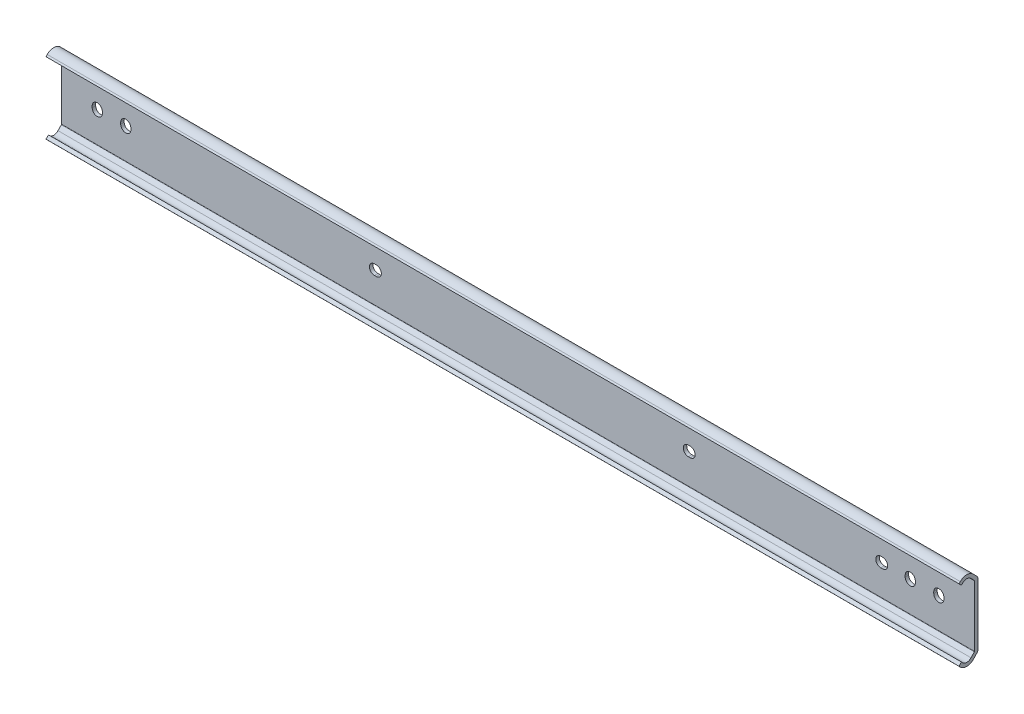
ISO-10303-21;
HEADER;
FILE_DESCRIPTION(('STEP AP214'),'2;1');
FILE_NAME('part.step','',(''),(''),'','','');
FILE_SCHEMA(('AUTOMOTIVE_DESIGN { 1 0 10303 214 1 1 1 1 }'));
ENDSEC;
DATA;
#1=APPLICATION_CONTEXT('core data for automotive mechanical design processes');
#2=APPLICATION_PROTOCOL_DEFINITION('international standard','automotive_design',2000,#1);
#3=PRODUCT_CONTEXT('',#1,'mechanical');
#4=PRODUCT('Part','Part','',(#3));
#5=PRODUCT_RELATED_PRODUCT_CATEGORY('part','',(#4));
#6=PRODUCT_DEFINITION_FORMATION('','',#4);
#7=PRODUCT_DEFINITION_CONTEXT('part definition',#1,'design');
#8=PRODUCT_DEFINITION('design','',#6,#7);
#9=PRODUCT_DEFINITION_SHAPE('','',#8);
#10=(LENGTH_UNIT() NAMED_UNIT(*) SI_UNIT(.MILLI.,.METRE.));
#11=(NAMED_UNIT(*) PLANE_ANGLE_UNIT() SI_UNIT($,.RADIAN.));
#12=(NAMED_UNIT(*) SI_UNIT($,.STERADIAN.) SOLID_ANGLE_UNIT());
#13=UNCERTAINTY_MEASURE_WITH_UNIT(LENGTH_MEASURE(1.E-05),#10,'distance_accuracy_value','');
#14=(GEOMETRIC_REPRESENTATION_CONTEXT(3) GLOBAL_UNCERTAINTY_ASSIGNED_CONTEXT((#13)) GLOBAL_UNIT_ASSIGNED_CONTEXT((#10,
#11,#12)) REPRESENTATION_CONTEXT('',''));
#15=CARTESIAN_POINT('',(0.,0.,0.));
#16=DIRECTION('',(0.,0.,1.));
#17=DIRECTION('',(1.,0.,0.));
#18=AXIS2_PLACEMENT_3D('',#15,#16,#17);
#19=CARTESIAN_POINT('',(390.5,13.5610179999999,1.54999923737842));
#20=DIRECTION('',(0.,0.,-1.));
#21=DIRECTION('',(1.,0.,0.));
#22=AXIS2_PLACEMENT_3D('',#19,#20,#21);
#23=PLANE('',#22);
#24=DIRECTION('',(0.,-1.,0.));
#25=VECTOR('',#24,1.);
#26=CARTESIAN_POINT('',(-15.9,13.5610179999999,1.54999923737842));
#27=LINE('',#26,#25);
#28=CARTESIAN_POINT('',(-15.9,13.5610179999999,1.54999923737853));
#29=VERTEX_POINT('',#28);
#30=CARTESIAN_POINT('',(-15.9,-13.5610179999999,1.54999923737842));
#31=VERTEX_POINT('',#30);
#32=EDGE_CURVE('E566',#29,#31,#27,.T.);
#33=ORIENTED_EDGE('',*,*,#32,.T.);
#34=DIRECTION('',(-1.,0.,0.));
#35=VECTOR('',#34,1.);
#36=CARTESIAN_POINT('',(390.5,-13.5610179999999,1.54999923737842));
#37=LINE('',#36,#35);
#38=CARTESIAN_POINT('',(390.5,-13.5610179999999,1.54999923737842));
#39=VERTEX_POINT('',#38);
#40=EDGE_CURVE('E659',#39,#31,#37,.T.);
#41=ORIENTED_EDGE('',*,*,#40,.F.);
#42=DIRECTION('',(0.,-1.,0.));
#43=VECTOR('',#42,1.);
#44=CARTESIAN_POINT('',(390.5,13.5610179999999,1.54999923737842));
#45=LINE('',#44,#43);
#46=CARTESIAN_POINT('',(390.5,13.5610179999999,1.54999923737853));
#47=VERTEX_POINT('',#46);
#48=EDGE_CURVE('E607',#47,#39,#45,.T.);
#49=ORIENTED_EDGE('',*,*,#48,.F.);
#50=DIRECTION('',(-1.,0.,0.));
#51=VECTOR('',#50,1.);
#52=CARTESIAN_POINT('',(390.5,13.5610179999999,1.54999923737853));
#53=LINE('',#52,#51);
#54=EDGE_CURVE('E662',#47,#29,#53,.T.);
#55=ORIENTED_EDGE('',*,*,#54,.T.);
#56=EDGE_LOOP('',(#33,#41,#49,#55));
#57=FACE_BOUND('',#56,.T.);
#58=DIRECTION('',(1.,0.,0.));
#59=VECTOR('',#58,1.);
#60=CARTESIAN_POINT('',(123.4,-2.24999999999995,1.54999923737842));
#61=LINE('',#60,#59);
#62=CARTESIAN_POINT('',(123.4,-2.24999999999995,1.54999923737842));
#63=VERTEX_POINT('',#62);
#64=CARTESIAN_POINT('',(124.2,-2.24999999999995,1.54999923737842));
#65=VERTEX_POINT('',#64);
#66=EDGE_CURVE('E346',#63,#65,#61,.T.);
#67=ORIENTED_EDGE('',*,*,#66,.F.);
#68=CARTESIAN_POINT('',(123.4,0.,1.54999923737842));
#69=DIRECTION('',(0.,0.,1.));
#70=DIRECTION('',(-1.,0.,0.));
#71=AXIS2_PLACEMENT_3D('',#68,#69,#70);
#72=CIRCLE('',#71,2.24999999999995);
#73=CARTESIAN_POINT('',(123.4,2.24999999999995,1.54999923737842));
#74=VERTEX_POINT('',#73);
#75=EDGE_CURVE('E29',#74,#63,#72,.T.);
#76=ORIENTED_EDGE('',*,*,#75,.F.);
#77=DIRECTION('',(-1.,0.,0.));
#78=VECTOR('',#77,1.);
#79=CARTESIAN_POINT('',(124.2,2.24999999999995,1.54999923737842));
#80=LINE('',#79,#78);
#81=CARTESIAN_POINT('',(124.2,2.24999999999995,1.54999923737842));
#82=VERTEX_POINT('',#81);
#83=EDGE_CURVE('E337',#82,#74,#80,.T.);
#84=ORIENTED_EDGE('',*,*,#83,.F.);
#85=CARTESIAN_POINT('',(124.2,0.,1.54999923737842));
#86=DIRECTION('',(0.,0.,1.));
#87=DIRECTION('',(-1.,0.,0.));
#88=AXIS2_PLACEMENT_3D('',#85,#86,#87);
#89=CIRCLE('',#88,2.24999999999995);
#90=EDGE_CURVE('E340',#65,#82,#89,.T.);
#91=ORIENTED_EDGE('',*,*,#90,.F.);
#92=EDGE_LOOP('',(#67,#76,#84,#91));
#93=FACE_BOUND('',#92,.T.);
#94=DIRECTION('',(1.,0.,0.));
#95=VECTOR('',#94,1.);
#96=CARTESIAN_POINT('',(263.1,-2.24999999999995,1.54999923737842));
#97=LINE('',#96,#95);
#98=CARTESIAN_POINT('',(263.1,-2.24999999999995,1.54999923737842));
#99=VERTEX_POINT('',#98);
#100=CARTESIAN_POINT('',(263.9,-2.24999999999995,1.54999923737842));
#101=VERTEX_POINT('',#100);
#102=EDGE_CURVE('E371',#99,#101,#97,.T.);
#103=ORIENTED_EDGE('',*,*,#102,.F.);
#104=CARTESIAN_POINT('',(263.1,0.,1.54999923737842));
#105=DIRECTION('',(0.,0.,1.));
#106=DIRECTION('',(-1.,0.,0.));
#107=AXIS2_PLACEMENT_3D('',#104,#105,#106);
#108=CIRCLE('',#107,2.24999999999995);
#109=CARTESIAN_POINT('',(263.1,2.24999999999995,1.54999923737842));
#110=VERTEX_POINT('',#109);
#111=EDGE_CURVE('E352',#110,#99,#108,.T.);
#112=ORIENTED_EDGE('',*,*,#111,.F.);
#113=DIRECTION('',(-1.,0.,0.));
#114=VECTOR('',#113,1.);
#115=CARTESIAN_POINT('',(263.9,2.24999999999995,1.54999923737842));
#116=LINE('',#115,#114);
#117=CARTESIAN_POINT('',(263.9,2.24999999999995,1.54999923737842));
#118=VERTEX_POINT('',#117);
#119=EDGE_CURVE('E360',#118,#110,#116,.T.);
#120=ORIENTED_EDGE('',*,*,#119,.F.);
#121=CARTESIAN_POINT('',(263.9,0.,1.54999923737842));
#122=DIRECTION('',(0.,0.,1.));
#123=DIRECTION('',(-1.,0.,0.));
#124=AXIS2_PLACEMENT_3D('',#121,#122,#123);
#125=CIRCLE('',#124,2.24999999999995);
#126=EDGE_CURVE('E374',#101,#118,#125,.T.);
#127=ORIENTED_EDGE('',*,*,#126,.F.);
#128=EDGE_LOOP('',(#103,#112,#120,#127));
#129=FACE_BOUND('',#128,.T.);
#130=DIRECTION('',(1.,0.,0.));
#131=VECTOR('',#130,1.);
#132=CARTESIAN_POINT('',(348.8,-2.24999999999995,1.54999923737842));
#133=LINE('',#132,#131);
#134=CARTESIAN_POINT('',(348.8,-2.24999999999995,1.54999923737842));
#135=VERTEX_POINT('',#134);
#136=CARTESIAN_POINT('',(349.6,-2.24999999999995,1.54999923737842));
#137=VERTEX_POINT('',#136);
#138=EDGE_CURVE('E403',#135,#137,#133,.T.);
#139=ORIENTED_EDGE('',*,*,#138,.F.);
#140=CARTESIAN_POINT('',(348.8,0.,1.54999923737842));
#141=DIRECTION('',(0.,0.,1.));
#142=DIRECTION('',(-1.,0.,0.));
#143=AXIS2_PLACEMENT_3D('',#140,#141,#142);
#144=CIRCLE('',#143,2.24999999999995);
#145=CARTESIAN_POINT('',(348.8,2.24999999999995,1.54999923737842));
#146=VERTEX_POINT('',#145);
#147=EDGE_CURVE('E381',#146,#135,#144,.T.);
#148=ORIENTED_EDGE('',*,*,#147,.F.);
#149=DIRECTION('',(-1.,0.,0.));
#150=VECTOR('',#149,1.);
#151=CARTESIAN_POINT('',(349.6,2.24999999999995,1.54999923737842));
#152=LINE('',#151,#150);
#153=CARTESIAN_POINT('',(349.6,2.24999999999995,1.54999923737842));
#154=VERTEX_POINT('',#153);
#155=EDGE_CURVE('E392',#154,#146,#152,.T.);
#156=ORIENTED_EDGE('',*,*,#155,.F.);
#157=CARTESIAN_POINT('',(349.6,0.,1.54999923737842));
#158=DIRECTION('',(0.,0.,1.));
#159=DIRECTION('',(-1.,0.,0.));
#160=AXIS2_PLACEMENT_3D('',#157,#158,#159);
#161=CIRCLE('',#160,2.24999999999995);
#162=EDGE_CURVE('E406',#137,#154,#161,.T.);
#163=ORIENTED_EDGE('',*,*,#162,.F.);
#164=EDGE_LOOP('',(#139,#148,#156,#163));
#165=FACE_BOUND('',#164,.T.);
#166=DIRECTION('',(0.,-1.,0.));
#167=VECTOR('',#166,1.);
#168=CARTESIAN_POINT('',(-2.25,-0.4,1.54999923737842));
#169=LINE('',#168,#167);
#170=CARTESIAN_POINT('',(-2.25,0.4,1.54999923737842));
#171=VERTEX_POINT('',#170);
#172=CARTESIAN_POINT('',(-2.25,-0.4,1.54999923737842));
#173=VERTEX_POINT('',#172);
#174=EDGE_CURVE('E435',#171,#173,#169,.T.);
#175=ORIENTED_EDGE('',*,*,#174,.F.);
#176=CARTESIAN_POINT('',(0.,0.4,1.54999923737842));
#177=DIRECTION('',(0.,0.,1.));
#178=DIRECTION('',(-1.,0.,0.));
#179=AXIS2_PLACEMENT_3D('',#176,#177,#178);
#180=CIRCLE('',#179,2.24999999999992);
#181=CARTESIAN_POINT('',(2.25,0.4,1.54999923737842));
#182=VERTEX_POINT('',#181);
#183=EDGE_CURVE('E413',#182,#171,#180,.T.);
#184=ORIENTED_EDGE('',*,*,#183,.F.);
#185=DIRECTION('',(0.,1.,0.));
#186=VECTOR('',#185,1.);
#187=CARTESIAN_POINT('',(2.25,-0.4,1.54999923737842));
#188=LINE('',#187,#186);
#189=CARTESIAN_POINT('',(2.25,-0.4,1.54999923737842));
#190=VERTEX_POINT('',#189);
#191=EDGE_CURVE('E424',#190,#182,#188,.T.);
#192=ORIENTED_EDGE('',*,*,#191,.F.);
#193=CARTESIAN_POINT('',(0.,-0.4,1.54999923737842));
#194=DIRECTION('',(0.,0.,1.));
#195=DIRECTION('',(-1.,0.,0.));
#196=AXIS2_PLACEMENT_3D('',#193,#194,#195);
#197=CIRCLE('',#196,2.24999999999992);
#198=EDGE_CURVE('E438',#173,#190,#197,.T.);
#199=ORIENTED_EDGE('',*,*,#198,.F.);
#200=EDGE_LOOP('',(#175,#184,#192,#199));
#201=FACE_BOUND('',#200,.T.);
#202=DIRECTION('',(0.,-1.,0.));
#203=VECTOR('',#202,1.);
#204=CARTESIAN_POINT('',(10.45,-0.4,1.54999923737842));
#205=LINE('',#204,#203);
#206=CARTESIAN_POINT('',(10.45,0.4,1.54999923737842));
#207=VERTEX_POINT('',#206);
#208=CARTESIAN_POINT('',(10.45,-0.4,1.54999923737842));
#209=VERTEX_POINT('',#208);
#210=EDGE_CURVE('E467',#207,#209,#205,.T.);
#211=ORIENTED_EDGE('',*,*,#210,.F.);
#212=CARTESIAN_POINT('',(12.7,0.4,1.54999923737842));
#213=DIRECTION('',(0.,0.,1.));
#214=DIRECTION('',(-1.,0.,0.));
#215=AXIS2_PLACEMENT_3D('',#212,#213,#214);
#216=CIRCLE('',#215,2.24999999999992);
#217=CARTESIAN_POINT('',(14.95,0.4,1.54999923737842));
#218=VERTEX_POINT('',#217);
#219=EDGE_CURVE('E445',#218,#207,#216,.T.);
#220=ORIENTED_EDGE('',*,*,#219,.F.);
#221=DIRECTION('',(0.,1.,0.));
#222=VECTOR('',#221,1.);
#223=CARTESIAN_POINT('',(14.95,-0.4,1.54999923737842));
#224=LINE('',#223,#222);
#225=CARTESIAN_POINT('',(14.95,-0.4,1.54999923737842));
#226=VERTEX_POINT('',#225);
#227=EDGE_CURVE('E456',#226,#218,#224,.T.);
#228=ORIENTED_EDGE('',*,*,#227,.F.);
#229=CARTESIAN_POINT('',(12.7,-0.4,1.54999923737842));
#230=DIRECTION('',(0.,0.,1.));
#231=DIRECTION('',(-1.,0.,0.));
#232=AXIS2_PLACEMENT_3D('',#229,#230,#231);
#233=CIRCLE('',#232,2.24999999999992);
#234=EDGE_CURVE('E470',#209,#226,#233,.T.);
#235=ORIENTED_EDGE('',*,*,#234,.F.);
#236=EDGE_LOOP('',(#211,#220,#228,#235));
#237=FACE_BOUND('',#236,.T.);
#238=DIRECTION('',(0.,-1.,0.));
#239=VECTOR('',#238,1.);
#240=CARTESIAN_POINT('',(359.65,-0.4,1.54999923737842));
#241=LINE('',#240,#239);
#242=CARTESIAN_POINT('',(359.65,0.4,1.54999923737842));
#243=VERTEX_POINT('',#242);
#244=CARTESIAN_POINT('',(359.65,-0.4,1.54999923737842));
#245=VERTEX_POINT('',#244);
#246=EDGE_CURVE('E499',#243,#245,#241,.T.);
#247=ORIENTED_EDGE('',*,*,#246,.F.);
#248=CARTESIAN_POINT('',(361.9,0.4,1.54999923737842));
#249=DIRECTION('',(0.,0.,1.));
#250=DIRECTION('',(-1.,0.,0.));
#251=AXIS2_PLACEMENT_3D('',#248,#249,#250);
#252=CIRCLE('',#251,2.24999999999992);
#253=CARTESIAN_POINT('',(364.15,0.4,1.54999923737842));
#254=VERTEX_POINT('',#253);
#255=EDGE_CURVE('E477',#254,#243,#252,.T.);
#256=ORIENTED_EDGE('',*,*,#255,.F.);
#257=DIRECTION('',(0.,1.,0.));
#258=VECTOR('',#257,1.);
#259=CARTESIAN_POINT('',(364.15,-0.4,1.54999923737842));
#260=LINE('',#259,#258);
#261=CARTESIAN_POINT('',(364.15,-0.4,1.54999923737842));
#262=VERTEX_POINT('',#261);
#263=EDGE_CURVE('E488',#262,#254,#260,.T.);
#264=ORIENTED_EDGE('',*,*,#263,.F.);
#265=CARTESIAN_POINT('',(361.9,-0.4,1.54999923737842));
#266=DIRECTION('',(0.,0.,1.));
#267=DIRECTION('',(-1.,0.,0.));
#268=AXIS2_PLACEMENT_3D('',#265,#266,#267);
#269=CIRCLE('',#268,2.24999999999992);
#270=EDGE_CURVE('E502',#245,#262,#269,.T.);
#271=ORIENTED_EDGE('',*,*,#270,.F.);
#272=EDGE_LOOP('',(#247,#256,#264,#271));
#273=FACE_BOUND('',#272,.T.);
#274=DIRECTION('',(0.,-1.,0.));
#275=VECTOR('',#274,1.);
#276=CARTESIAN_POINT('',(372.35,-0.4,1.54999923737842));
#277=LINE('',#276,#275);
#278=CARTESIAN_POINT('',(372.35,0.4,1.54999923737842));
#279=VERTEX_POINT('',#278);
#280=CARTESIAN_POINT('',(372.35,-0.4,1.54999923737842));
#281=VERTEX_POINT('',#280);
#282=EDGE_CURVE('E531',#279,#281,#277,.T.);
#283=ORIENTED_EDGE('',*,*,#282,.F.);
#284=CARTESIAN_POINT('',(374.6,0.4,1.54999923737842));
#285=DIRECTION('',(0.,0.,1.));
#286=DIRECTION('',(-1.,0.,0.));
#287=AXIS2_PLACEMENT_3D('',#284,#285,#286);
#288=CIRCLE('',#287,2.24999999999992);
#289=CARTESIAN_POINT('',(376.85,0.4,1.54999923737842));
#290=VERTEX_POINT('',#289);
#291=EDGE_CURVE('E509',#290,#279,#288,.T.);
#292=ORIENTED_EDGE('',*,*,#291,.F.);
#293=DIRECTION('',(0.,1.,0.));
#294=VECTOR('',#293,1.);
#295=CARTESIAN_POINT('',(376.85,-0.4,1.54999923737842));
#296=LINE('',#295,#294);
#297=CARTESIAN_POINT('',(376.85,-0.4,1.54999923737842));
#298=VERTEX_POINT('',#297);
#299=EDGE_CURVE('E520',#298,#290,#296,.T.);
#300=ORIENTED_EDGE('',*,*,#299,.F.);
#301=CARTESIAN_POINT('',(374.6,-0.4,1.54999923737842));
#302=DIRECTION('',(0.,0.,1.));
#303=DIRECTION('',(-1.,0.,0.));
#304=AXIS2_PLACEMENT_3D('',#301,#302,#303);
#305=CIRCLE('',#304,2.24999999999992);
#306=EDGE_CURVE('E534',#281,#298,#305,.T.);
#307=ORIENTED_EDGE('',*,*,#306,.F.);
#308=EDGE_LOOP('',(#283,#292,#300,#307));
#309=FACE_BOUND('',#308,.T.);
#310=ADVANCED_FACE('F14',(#57,#93,#129,#165,#201,#237,#273,#309),#23,.F.);
#311=CARTESIAN_POINT('',(390.5,13.5610176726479,0.));
#312=DIRECTION('',(0.,0.,1.));
#313=DIRECTION('',(-1.,0.,0.));
#314=AXIS2_PLACEMENT_3D('',#311,#312,#313);
#315=PLANE('',#314);
#316=DIRECTION('',(-1.,0.,0.));
#317=VECTOR('',#316,1.);
#318=CARTESIAN_POINT('',(124.2,2.24999999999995,0.));
#319=LINE('',#318,#317);
#320=CARTESIAN_POINT('',(124.2,2.24999999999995,0.));
#321=VERTEX_POINT('',#320);
#322=CARTESIAN_POINT('',(123.4,2.24999999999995,0.));
#323=VERTEX_POINT('',#322);
#324=EDGE_CURVE('E327',#321,#323,#319,.T.);
#325=ORIENTED_EDGE('',*,*,#324,.T.);
#326=CARTESIAN_POINT('',(123.4,0.,0.));
#327=DIRECTION('',(0.,0.,1.));
#328=DIRECTION('',(-1.,0.,0.));
#329=AXIS2_PLACEMENT_3D('',#326,#327,#328);
#330=CIRCLE('',#329,2.24999999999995);
#331=CARTESIAN_POINT('',(123.4,-2.24999999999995,0.));
#332=VERTEX_POINT('',#331);
#333=EDGE_CURVE('E321',#323,#332,#330,.T.);
#334=ORIENTED_EDGE('',*,*,#333,.T.);
#335=DIRECTION('',(1.,0.,0.));
#336=VECTOR('',#335,1.);
#337=CARTESIAN_POINT('',(123.4,-2.24999999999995,0.));
#338=LINE('',#337,#336);
#339=CARTESIAN_POINT('',(124.2,-2.24999999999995,0.));
#340=VERTEX_POINT('',#339);
#341=EDGE_CURVE('E330',#332,#340,#338,.T.);
#342=ORIENTED_EDGE('',*,*,#341,.T.);
#343=CARTESIAN_POINT('',(124.2,0.,0.));
#344=DIRECTION('',(0.,0.,1.));
#345=DIRECTION('',(-1.,0.,0.));
#346=AXIS2_PLACEMENT_3D('',#343,#344,#345);
#347=CIRCLE('',#346,2.24999999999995);
#348=EDGE_CURVE('E37',#340,#321,#347,.T.);
#349=ORIENTED_EDGE('',*,*,#348,.T.);
#350=EDGE_LOOP('',(#325,#334,#342,#349));
#351=FACE_BOUND('',#350,.T.);
#352=DIRECTION('',(-1.,0.,0.));
#353=VECTOR('',#352,1.);
#354=CARTESIAN_POINT('',(263.9,2.24999999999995,0.));
#355=LINE('',#354,#353);
#356=CARTESIAN_POINT('',(263.9,2.24999999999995,0.));
#357=VERTEX_POINT('',#356);
#358=CARTESIAN_POINT('',(263.1,2.24999999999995,0.));
#359=VERTEX_POINT('',#358);
#360=EDGE_CURVE('E366',#357,#359,#355,.T.);
#361=ORIENTED_EDGE('',*,*,#360,.T.);
#362=CARTESIAN_POINT('',(263.1,0.,0.));
#363=DIRECTION('',(0.,0.,1.));
#364=DIRECTION('',(-1.,0.,0.));
#365=AXIS2_PLACEMENT_3D('',#362,#363,#364);
#366=CIRCLE('',#365,2.24999999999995);
#367=CARTESIAN_POINT('',(263.1,-2.24999999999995,0.));
#368=VERTEX_POINT('',#367);
#369=EDGE_CURVE('E356',#359,#368,#366,.T.);
#370=ORIENTED_EDGE('',*,*,#369,.T.);
#371=DIRECTION('',(1.,0.,0.));
#372=VECTOR('',#371,1.);
#373=CARTESIAN_POINT('',(263.1,-2.24999999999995,0.));
#374=LINE('',#373,#372);
#375=CARTESIAN_POINT('',(263.9,-2.24999999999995,0.));
#376=VERTEX_POINT('',#375);
#377=EDGE_CURVE('E359',#368,#376,#374,.T.);
#378=ORIENTED_EDGE('',*,*,#377,.T.);
#379=CARTESIAN_POINT('',(263.9,0.,0.));
#380=DIRECTION('',(0.,0.,1.));
#381=DIRECTION('',(-1.,0.,0.));
#382=AXIS2_PLACEMENT_3D('',#379,#380,#381);
#383=CIRCLE('',#382,2.24999999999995);
#384=EDGE_CURVE('E363',#376,#357,#383,.T.);
#385=ORIENTED_EDGE('',*,*,#384,.T.);
#386=EDGE_LOOP('',(#361,#370,#378,#385));
#387=FACE_BOUND('',#386,.T.);
#388=DIRECTION('',(-1.,0.,0.));
#389=VECTOR('',#388,1.);
#390=CARTESIAN_POINT('',(349.6,2.24999999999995,0.));
#391=LINE('',#390,#389);
#392=CARTESIAN_POINT('',(349.6,2.24999999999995,0.));
#393=VERTEX_POINT('',#392);
#394=CARTESIAN_POINT('',(348.8,2.24999999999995,0.));
#395=VERTEX_POINT('',#394);
#396=EDGE_CURVE('E398',#393,#395,#391,.T.);
#397=ORIENTED_EDGE('',*,*,#396,.T.);
#398=CARTESIAN_POINT('',(348.8,0.,0.));
#399=DIRECTION('',(0.,0.,1.));
#400=DIRECTION('',(-1.,0.,0.));
#401=AXIS2_PLACEMENT_3D('',#398,#399,#400);
#402=CIRCLE('',#401,2.24999999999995);
#403=CARTESIAN_POINT('',(348.8,-2.24999999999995,0.));
#404=VERTEX_POINT('',#403);
#405=EDGE_CURVE('E388',#395,#404,#402,.T.);
#406=ORIENTED_EDGE('',*,*,#405,.T.);
#407=DIRECTION('',(1.,0.,0.));
#408=VECTOR('',#407,1.);
#409=CARTESIAN_POINT('',(348.8,-2.24999999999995,0.));
#410=LINE('',#409,#408);
#411=CARTESIAN_POINT('',(349.6,-2.24999999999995,0.));
#412=VERTEX_POINT('',#411);
#413=EDGE_CURVE('E391',#404,#412,#410,.T.);
#414=ORIENTED_EDGE('',*,*,#413,.T.);
#415=CARTESIAN_POINT('',(349.6,0.,0.));
#416=DIRECTION('',(0.,0.,1.));
#417=DIRECTION('',(-1.,0.,0.));
#418=AXIS2_PLACEMENT_3D('',#415,#416,#417);
#419=CIRCLE('',#418,2.24999999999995);
#420=EDGE_CURVE('E395',#412,#393,#419,.T.);
#421=ORIENTED_EDGE('',*,*,#420,.T.);
#422=EDGE_LOOP('',(#397,#406,#414,#421));
#423=FACE_BOUND('',#422,.T.);
#424=DIRECTION('',(0.,1.,0.));
#425=VECTOR('',#424,1.);
#426=CARTESIAN_POINT('',(2.25,-0.4,0.));
#427=LINE('',#426,#425);
#428=CARTESIAN_POINT('',(2.25,-0.4,0.));
#429=VERTEX_POINT('',#428);
#430=CARTESIAN_POINT('',(2.25,0.4,0.));
#431=VERTEX_POINT('',#430);
#432=EDGE_CURVE('E430',#429,#431,#427,.T.);
#433=ORIENTED_EDGE('',*,*,#432,.T.);
#434=CARTESIAN_POINT('',(0.,0.4,0.));
#435=DIRECTION('',(0.,0.,1.));
#436=DIRECTION('',(-1.,0.,0.));
#437=AXIS2_PLACEMENT_3D('',#434,#435,#436);
#438=CIRCLE('',#437,2.24999999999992);
#439=CARTESIAN_POINT('',(-2.25,0.4,0.));
#440=VERTEX_POINT('',#439);
#441=EDGE_CURVE('E420',#431,#440,#438,.T.);
#442=ORIENTED_EDGE('',*,*,#441,.T.);
#443=DIRECTION('',(0.,-1.,0.));
#444=VECTOR('',#443,1.);
#445=CARTESIAN_POINT('',(-2.25,-0.4,0.));
#446=LINE('',#445,#444);
#447=CARTESIAN_POINT('',(-2.25,-0.4,0.));
#448=VERTEX_POINT('',#447);
#449=EDGE_CURVE('E423',#440,#448,#446,.T.);
#450=ORIENTED_EDGE('',*,*,#449,.T.);
#451=CARTESIAN_POINT('',(0.,-0.4,0.));
#452=DIRECTION('',(0.,0.,1.));
#453=DIRECTION('',(-1.,0.,0.));
#454=AXIS2_PLACEMENT_3D('',#451,#452,#453);
#455=CIRCLE('',#454,2.24999999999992);
#456=EDGE_CURVE('E427',#448,#429,#455,.T.);
#457=ORIENTED_EDGE('',*,*,#456,.T.);
#458=EDGE_LOOP('',(#433,#442,#450,#457));
#459=FACE_BOUND('',#458,.T.);
#460=DIRECTION('',(0.,1.,0.));
#461=VECTOR('',#460,1.);
#462=CARTESIAN_POINT('',(14.95,-0.4,0.));
#463=LINE('',#462,#461);
#464=CARTESIAN_POINT('',(14.95,-0.4,0.));
#465=VERTEX_POINT('',#464);
#466=CARTESIAN_POINT('',(14.95,0.4,0.));
#467=VERTEX_POINT('',#466);
#468=EDGE_CURVE('E462',#465,#467,#463,.T.);
#469=ORIENTED_EDGE('',*,*,#468,.T.);
#470=CARTESIAN_POINT('',(12.7,0.4,0.));
#471=DIRECTION('',(0.,0.,1.));
#472=DIRECTION('',(-1.,0.,0.));
#473=AXIS2_PLACEMENT_3D('',#470,#471,#472);
#474=CIRCLE('',#473,2.24999999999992);
#475=CARTESIAN_POINT('',(10.45,0.4,0.));
#476=VERTEX_POINT('',#475);
#477=EDGE_CURVE('E452',#467,#476,#474,.T.);
#478=ORIENTED_EDGE('',*,*,#477,.T.);
#479=DIRECTION('',(0.,-1.,0.));
#480=VECTOR('',#479,1.);
#481=CARTESIAN_POINT('',(10.45,-0.4,0.));
#482=LINE('',#481,#480);
#483=CARTESIAN_POINT('',(10.45,-0.4,0.));
#484=VERTEX_POINT('',#483);
#485=EDGE_CURVE('E455',#476,#484,#482,.T.);
#486=ORIENTED_EDGE('',*,*,#485,.T.);
#487=CARTESIAN_POINT('',(12.7,-0.4,0.));
#488=DIRECTION('',(0.,0.,1.));
#489=DIRECTION('',(-1.,0.,0.));
#490=AXIS2_PLACEMENT_3D('',#487,#488,#489);
#491=CIRCLE('',#490,2.24999999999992);
#492=EDGE_CURVE('E459',#484,#465,#491,.T.);
#493=ORIENTED_EDGE('',*,*,#492,.T.);
#494=EDGE_LOOP('',(#469,#478,#486,#493));
#495=FACE_BOUND('',#494,.T.);
#496=DIRECTION('',(0.,1.,0.));
#497=VECTOR('',#496,1.);
#498=CARTESIAN_POINT('',(364.15,-0.4,0.));
#499=LINE('',#498,#497);
#500=CARTESIAN_POINT('',(364.15,-0.4,0.));
#501=VERTEX_POINT('',#500);
#502=CARTESIAN_POINT('',(364.15,0.4,0.));
#503=VERTEX_POINT('',#502);
#504=EDGE_CURVE('E494',#501,#503,#499,.T.);
#505=ORIENTED_EDGE('',*,*,#504,.T.);
#506=CARTESIAN_POINT('',(361.9,0.4,0.));
#507=DIRECTION('',(0.,0.,1.));
#508=DIRECTION('',(-1.,0.,0.));
#509=AXIS2_PLACEMENT_3D('',#506,#507,#508);
#510=CIRCLE('',#509,2.24999999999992);
#511=CARTESIAN_POINT('',(359.65,0.4,0.));
#512=VERTEX_POINT('',#511);
#513=EDGE_CURVE('E484',#503,#512,#510,.T.);
#514=ORIENTED_EDGE('',*,*,#513,.T.);
#515=DIRECTION('',(0.,-1.,0.));
#516=VECTOR('',#515,1.);
#517=CARTESIAN_POINT('',(359.65,-0.4,0.));
#518=LINE('',#517,#516);
#519=CARTESIAN_POINT('',(359.65,-0.4,0.));
#520=VERTEX_POINT('',#519);
#521=EDGE_CURVE('E487',#512,#520,#518,.T.);
#522=ORIENTED_EDGE('',*,*,#521,.T.);
#523=CARTESIAN_POINT('',(361.9,-0.4,0.));
#524=DIRECTION('',(0.,0.,1.));
#525=DIRECTION('',(-1.,0.,0.));
#526=AXIS2_PLACEMENT_3D('',#523,#524,#525);
#527=CIRCLE('',#526,2.24999999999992);
#528=EDGE_CURVE('E491',#520,#501,#527,.T.);
#529=ORIENTED_EDGE('',*,*,#528,.T.);
#530=EDGE_LOOP('',(#505,#514,#522,#529));
#531=FACE_BOUND('',#530,.T.);
#532=DIRECTION('',(0.,1.,0.));
#533=VECTOR('',#532,1.);
#534=CARTESIAN_POINT('',(376.85,-0.4,0.));
#535=LINE('',#534,#533);
#536=CARTESIAN_POINT('',(376.85,-0.4,0.));
#537=VERTEX_POINT('',#536);
#538=CARTESIAN_POINT('',(376.85,0.4,0.));
#539=VERTEX_POINT('',#538);
#540=EDGE_CURVE('E526',#537,#539,#535,.T.);
#541=ORIENTED_EDGE('',*,*,#540,.T.);
#542=CARTESIAN_POINT('',(374.6,0.4,0.));
#543=DIRECTION('',(0.,0.,1.));
#544=DIRECTION('',(-1.,0.,0.));
#545=AXIS2_PLACEMENT_3D('',#542,#543,#544);
#546=CIRCLE('',#545,2.24999999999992);
#547=CARTESIAN_POINT('',(372.35,0.4,0.));
#548=VERTEX_POINT('',#547);
#549=EDGE_CURVE('E516',#539,#548,#546,.T.);
#550=ORIENTED_EDGE('',*,*,#549,.T.);
#551=DIRECTION('',(0.,-1.,0.));
#552=VECTOR('',#551,1.);
#553=CARTESIAN_POINT('',(372.35,-0.4,0.));
#554=LINE('',#553,#552);
#555=CARTESIAN_POINT('',(372.35,-0.4,0.));
#556=VERTEX_POINT('',#555);
#557=EDGE_CURVE('E519',#548,#556,#554,.T.);
#558=ORIENTED_EDGE('',*,*,#557,.T.);
#559=CARTESIAN_POINT('',(374.6,-0.4,0.));
#560=DIRECTION('',(0.,0.,1.));
#561=DIRECTION('',(-1.,0.,0.));
#562=AXIS2_PLACEMENT_3D('',#559,#560,#561);
#563=CIRCLE('',#562,2.24999999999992);
#564=EDGE_CURVE('E523',#556,#537,#563,.T.);
#565=ORIENTED_EDGE('',*,*,#564,.T.);
#566=EDGE_LOOP('',(#541,#550,#558,#565));
#567=FACE_BOUND('',#566,.T.);
#568=DIRECTION('',(0.,1.,0.));
#569=VECTOR('',#568,1.);
#570=CARTESIAN_POINT('',(-15.9,13.5610176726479,0.));
#571=LINE('',#570,#569);
#572=CARTESIAN_POINT('',(-15.9,-13.5610176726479,0.));
#573=VERTEX_POINT('',#572);
#574=CARTESIAN_POINT('',(-15.9,13.5610176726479,0.));
#575=VERTEX_POINT('',#574);
#576=EDGE_CURVE('E586',#573,#575,#571,.T.);
#577=ORIENTED_EDGE('',*,*,#576,.T.);
#578=DIRECTION('',(-1.,0.,0.));
#579=VECTOR('',#578,1.);
#580=CARTESIAN_POINT('',(390.5,13.5610176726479,0.));
#581=LINE('',#580,#579);
#582=CARTESIAN_POINT('',(390.5,13.5610176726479,0.));
#583=VERTEX_POINT('',#582);
#584=EDGE_CURVE('E629',#583,#575,#581,.T.);
#585=ORIENTED_EDGE('',*,*,#584,.F.);
#586=DIRECTION('',(0.,1.,0.));
#587=VECTOR('',#586,1.);
#588=CARTESIAN_POINT('',(390.5,13.5610176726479,0.));
#589=LINE('',#588,#587);
#590=CARTESIAN_POINT('',(390.5,-13.5610176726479,0.));
#591=VERTEX_POINT('',#590);
#592=EDGE_CURVE('E627',#591,#583,#589,.T.);
#593=ORIENTED_EDGE('',*,*,#592,.F.);
#594=DIRECTION('',(-1.,0.,0.));
#595=VECTOR('',#594,1.);
#596=CARTESIAN_POINT('',(390.5,-13.5610176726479,0.));
#597=LINE('',#596,#595);
#598=EDGE_CURVE('E632',#591,#573,#597,.T.);
#599=ORIENTED_EDGE('',*,*,#598,.T.);
#600=EDGE_LOOP('',(#577,#585,#593,#599));
#601=FACE_BOUND('',#600,.T.);
#602=ADVANCED_FACE('F334',(#351,#387,#423,#459,#495,#531,#567,#601),#315,.F.);
#603=CARTESIAN_POINT('',(390.5,13.5610175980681,1.80000204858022));
#604=DIRECTION('',(-1.,0.,0.));
#605=DIRECTION('',(0.,0.,-1.));
#606=AXIS2_PLACEMENT_3D('',#603,#604,#605);
#607=PLANE('',#606);
#608=ORIENTED_EDGE('',*,*,#592,.T.);
#609=CARTESIAN_POINT('',(390.5,13.5610175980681,1.80000204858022));
#610=DIRECTION('',(1.,0.,0.));
#611=DIRECTION('',(0.,0.,-1.));
#612=AXIS2_PLACEMENT_3D('',#609,#610,#611);
#613=CIRCLE('',#612,1.80000204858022);
#614=CARTESIAN_POINT('',(390.5,14.8073560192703,0.501291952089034));
#615=VERTEX_POINT('',#614);
#616=EDGE_CURVE('E588',#583,#615,#613,.T.);
#617=ORIENTED_EDGE('',*,*,#616,.T.);
#618=DIRECTION('',(0.,0.721504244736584,0.692410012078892));
#619=VECTOR('',#618,1.);
#620=CARTESIAN_POINT('',(390.5,14.8073560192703,0.501291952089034));
#621=LINE('',#620,#619);
#622=CARTESIAN_POINT('',(390.5,16.4741380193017,2.10086195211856));
#623=VERTEX_POINT('',#622);
#624=EDGE_CURVE('E591',#615,#623,#621,.T.);
#625=ORIENTED_EDGE('',*,*,#624,.T.);
#626=CARTESIAN_POINT('',(390.5,13.5750002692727,4.99999970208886));
#627=DIRECTION('',(1.,0.,0.));
#628=DIRECTION('',(0.,0.,-1.));
#629=AXIS2_PLACEMENT_3D('',#626,#627,#628);
#630=CIRCLE('',#629,4.09999992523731);
#631=CARTESIAN_POINT('',(390.5,16.4741385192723,7.89913695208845));
#632=VERTEX_POINT('',#631);
#633=EDGE_CURVE('E593',#623,#632,#630,.T.);
#634=ORIENTED_EDGE('',*,*,#633,.T.);
#635=DIRECTION('',(0.,-0.721503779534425,0.692410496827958));
#636=VECTOR('',#635,1.);
#637=CARTESIAN_POINT('',(390.5,16.4741385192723,7.89913695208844));
#638=LINE('',#637,#636);
#639=CARTESIAN_POINT('',(390.5,15.8897095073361,8.45999996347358));
#640=VERTEX_POINT('',#639);
#641=EDGE_CURVE('E595',#632,#640,#638,.T.);
#642=ORIENTED_EDGE('',*,*,#641,.T.);
#643=DIRECTION('',(0.,-0.707106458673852,-0.707107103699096));
#644=VECTOR('',#643,1.);
#645=CARTESIAN_POINT('',(390.5,14.7934625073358,7.36375196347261));
#646=LINE('',#645,#644);
#647=CARTESIAN_POINT('',(390.5,14.7934625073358,7.36375196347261));
#648=VERTEX_POINT('',#647);
#649=EDGE_CURVE('E597',#640,#648,#646,.T.);
#650=ORIENTED_EDGE('',*,*,#649,.T.);
#651=DIRECTION('',(0.,0.721504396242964,-0.692409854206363));
#652=VECTOR('',#651,1.);
#653=CARTESIAN_POINT('',(390.5,15.2920597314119,6.88526058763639));
#654=LINE('',#653,#652);
#655=CARTESIAN_POINT('',(390.5,15.2920597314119,6.88526058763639));
#656=VERTEX_POINT('',#655);
#657=EDGE_CURVE('E599',#648,#656,#654,.T.);
#658=ORIENTED_EDGE('',*,*,#657,.T.);
#659=CARTESIAN_POINT('',(390.5,13.5750002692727,4.99999970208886));
#660=DIRECTION('',(-1.,0.,0.));
#661=DIRECTION('',(0.,0.,1.));
#662=AXIS2_PLACEMENT_3D('',#659,#660,#661);
#663=CIRCLE('',#662,2.55000035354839);
#664=CARTESIAN_POINT('',(390.5,15.2920521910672,3.11473194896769));
#665=VERTEX_POINT('',#664);
#666=EDGE_CURVE('E601',#656,#665,#663,.T.);
#667=ORIENTED_EDGE('',*,*,#666,.T.);
#668=DIRECTION('',(0.,-0.72150413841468,-0.692410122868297));
#669=VECTOR('',#668,1.);
#670=CARTESIAN_POINT('',(390.5,13.7341215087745,1.61962344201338));
#671=LINE('',#670,#669);
#672=CARTESIAN_POINT('',(390.5,13.7341215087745,1.61962344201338));
#673=VERTEX_POINT('',#672);
#674=EDGE_CURVE('E603',#665,#673,#671,.T.);
#675=ORIENTED_EDGE('',*,*,#674,.T.);
#676=CARTESIAN_POINT('',(390.5,13.5610175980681,1.80000204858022));
#677=DIRECTION('',(-1.,0.,0.));
#678=DIRECTION('',(0.,0.,1.));
#679=AXIS2_PLACEMENT_3D('',#676,#677,#678);
#680=CIRCLE('',#679,0.250002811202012);
#681=EDGE_CURVE('E605',#673,#47,#680,.T.);
#682=ORIENTED_EDGE('',*,*,#681,.T.);
#683=ORIENTED_EDGE('',*,*,#48,.T.);
#684=CARTESIAN_POINT('',(390.5,-13.5610175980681,1.80000204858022));
#685=DIRECTION('',(-1.,0.,0.));
#686=DIRECTION('',(0.,0.,-1.));
#687=AXIS2_PLACEMENT_3D('',#684,#685,#686);
#688=CIRCLE('',#687,0.250002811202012);
#689=CARTESIAN_POINT('',(390.5,-13.7341215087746,1.6196234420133));
#690=VERTEX_POINT('',#689);
#691=EDGE_CURVE('E609',#39,#690,#688,.T.);
#692=ORIENTED_EDGE('',*,*,#691,.T.);
#693=DIRECTION('',(0.,-0.72150413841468,0.692410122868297));
#694=VECTOR('',#693,1.);
#695=CARTESIAN_POINT('',(390.5,-13.7341215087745,1.61962344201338));
#696=LINE('',#695,#694);
#697=CARTESIAN_POINT('',(390.5,-15.2920521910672,3.11473194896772));
#698=VERTEX_POINT('',#697);
#699=EDGE_CURVE('E611',#690,#698,#696,.T.);
#700=ORIENTED_EDGE('',*,*,#699,.T.);
#701=CARTESIAN_POINT('',(390.5,-13.5750002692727,4.99999970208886));
#702=DIRECTION('',(-1.,0.,0.));
#703=DIRECTION('',(0.,0.,-1.));
#704=AXIS2_PLACEMENT_3D('',#701,#702,#703);
#705=CIRCLE('',#704,2.55000035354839);
#706=CARTESIAN_POINT('',(390.5,-15.2920597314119,6.88526058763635));
#707=VERTEX_POINT('',#706);
#708=EDGE_CURVE('E613',#698,#707,#705,.T.);
#709=ORIENTED_EDGE('',*,*,#708,.T.);
#710=DIRECTION('',(0.,0.721504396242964,0.692409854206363));
#711=VECTOR('',#710,1.);
#712=CARTESIAN_POINT('',(390.5,-15.2920597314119,6.88526058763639));
#713=LINE('',#712,#711);
#714=CARTESIAN_POINT('',(390.5,-14.7934625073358,7.36375196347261));
#715=VERTEX_POINT('',#714);
#716=EDGE_CURVE('E615',#707,#715,#713,.T.);
#717=ORIENTED_EDGE('',*,*,#716,.T.);
#718=DIRECTION('',(0.,-0.707106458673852,0.707107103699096));
#719=VECTOR('',#718,1.);
#720=CARTESIAN_POINT('',(390.5,-14.7934625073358,7.36375196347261));
#721=LINE('',#720,#719);
#722=CARTESIAN_POINT('',(390.5,-15.8897095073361,8.45999996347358));
#723=VERTEX_POINT('',#722);
#724=EDGE_CURVE('E617',#715,#723,#721,.T.);
#725=ORIENTED_EDGE('',*,*,#724,.T.);
#726=DIRECTION('',(0.,-0.721503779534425,-0.692410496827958));
#727=VECTOR('',#726,1.);
#728=CARTESIAN_POINT('',(390.5,-16.4741385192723,7.89913695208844));
#729=LINE('',#728,#727);
#730=CARTESIAN_POINT('',(390.5,-16.4741385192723,7.89913695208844));
#731=VERTEX_POINT('',#730);
#732=EDGE_CURVE('E619',#723,#731,#729,.T.);
#733=ORIENTED_EDGE('',*,*,#732,.T.);
#734=CARTESIAN_POINT('',(390.5,-13.5750002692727,4.99999970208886));
#735=DIRECTION('',(1.,0.,0.));
#736=DIRECTION('',(0.,0.,1.));
#737=AXIS2_PLACEMENT_3D('',#734,#735,#736);
#738=CIRCLE('',#737,4.09999992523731);
#739=CARTESIAN_POINT('',(390.5,-16.4741380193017,2.10086195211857));
#740=VERTEX_POINT('',#739);
#741=EDGE_CURVE('E621',#731,#740,#738,.T.);
#742=ORIENTED_EDGE('',*,*,#741,.T.);
#743=DIRECTION('',(0.,0.721504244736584,-0.692410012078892));
#744=VECTOR('',#743,1.);
#745=CARTESIAN_POINT('',(390.5,-14.8073560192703,0.501291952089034));
#746=LINE('',#745,#744);
#747=CARTESIAN_POINT('',(390.5,-14.8073560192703,0.501291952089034));
#748=VERTEX_POINT('',#747);
#749=EDGE_CURVE('E623',#740,#748,#746,.T.);
#750=ORIENTED_EDGE('',*,*,#749,.T.);
#751=CARTESIAN_POINT('',(390.5,-13.5610175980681,1.80000204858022));
#752=DIRECTION('',(1.,0.,0.));
#753=DIRECTION('',(0.,0.,1.));
#754=AXIS2_PLACEMENT_3D('',#751,#752,#753);
#755=CIRCLE('',#754,1.80000204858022);
#756=EDGE_CURVE('E625',#748,#591,#755,.T.);
#757=ORIENTED_EDGE('',*,*,#756,.T.);
#758=EDGE_LOOP('',(#608,#617,#625,#634,#642,#650,#658,#667,#675,#682,#683,#692,#700,#709,#717,
#725,#733,#742,#750,#757));
#759=FACE_BOUND('',#758,.T.);
#760=ADVANCED_FACE('F707',(#759),#607,.F.);
#761=CARTESIAN_POINT('',(-15.9,13.5610175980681,1.80000204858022));
#762=DIRECTION('',(-1.,0.,0.));
#763=DIRECTION('',(0.,0.,-1.));
#764=AXIS2_PLACEMENT_3D('',#761,#762,#763);
#765=PLANE('',#764);
#766=CARTESIAN_POINT('',(-15.9,-13.5610175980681,1.80000204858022));
#767=DIRECTION('',(-1.,0.,0.));
#768=DIRECTION('',(0.,0.,-1.));
#769=AXIS2_PLACEMENT_3D('',#766,#767,#768);
#770=CIRCLE('',#769,0.250002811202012);
#771=CARTESIAN_POINT('',(-15.9,-13.7341215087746,1.6196234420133));
#772=VERTEX_POINT('',#771);
#773=EDGE_CURVE('E568',#31,#772,#770,.T.);
#774=ORIENTED_EDGE('',*,*,#773,.F.);
#775=ORIENTED_EDGE('',*,*,#32,.F.);
#776=CARTESIAN_POINT('',(-15.9,13.5610175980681,1.80000204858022));
#777=DIRECTION('',(-1.,0.,0.));
#778=DIRECTION('',(0.,0.,1.));
#779=AXIS2_PLACEMENT_3D('',#776,#777,#778);
#780=CIRCLE('',#779,0.250002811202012);
#781=CARTESIAN_POINT('',(-15.9,13.7341215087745,1.61962344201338));
#782=VERTEX_POINT('',#781);
#783=EDGE_CURVE('E564',#782,#29,#780,.T.);
#784=ORIENTED_EDGE('',*,*,#783,.F.);
#785=DIRECTION('',(0.,-0.72150413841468,-0.692410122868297));
#786=VECTOR('',#785,1.);
#787=CARTESIAN_POINT('',(-15.9,13.7341215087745,1.61962344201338));
#788=LINE('',#787,#786);
#789=CARTESIAN_POINT('',(-15.9,15.2920521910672,3.11473194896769));
#790=VERTEX_POINT('',#789);
#791=EDGE_CURVE('E562',#790,#782,#788,.T.);
#792=ORIENTED_EDGE('',*,*,#791,.F.);
#793=CARTESIAN_POINT('',(-15.9,13.5750002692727,4.99999970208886));
#794=DIRECTION('',(-1.,0.,0.));
#795=DIRECTION('',(0.,0.,1.));
#796=AXIS2_PLACEMENT_3D('',#793,#794,#795);
#797=CIRCLE('',#796,2.55000035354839);
#798=CARTESIAN_POINT('',(-15.9,15.2920597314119,6.88526058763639));
#799=VERTEX_POINT('',#798);
#800=EDGE_CURVE('E560',#799,#790,#797,.T.);
#801=ORIENTED_EDGE('',*,*,#800,.F.);
#802=DIRECTION('',(0.,0.721504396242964,-0.692409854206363));
#803=VECTOR('',#802,1.);
#804=CARTESIAN_POINT('',(-15.9,15.2920597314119,6.88526058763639));
#805=LINE('',#804,#803);
#806=CARTESIAN_POINT('',(-15.9,14.7934625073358,7.36375196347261));
#807=VERTEX_POINT('',#806);
#808=EDGE_CURVE('E558',#807,#799,#805,.T.);
#809=ORIENTED_EDGE('',*,*,#808,.F.);
#810=DIRECTION('',(0.,-0.707106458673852,-0.707107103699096));
#811=VECTOR('',#810,1.);
#812=CARTESIAN_POINT('',(-15.9,14.7934625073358,7.36375196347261));
#813=LINE('',#812,#811);
#814=CARTESIAN_POINT('',(-15.9,15.8897095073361,8.45999996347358));
#815=VERTEX_POINT('',#814);
#816=EDGE_CURVE('E556',#815,#807,#813,.T.);
#817=ORIENTED_EDGE('',*,*,#816,.F.);
#818=DIRECTION('',(0.,-0.721503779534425,0.692410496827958));
#819=VECTOR('',#818,1.);
#820=CARTESIAN_POINT('',(-15.9,16.4741385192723,7.89913695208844));
#821=LINE('',#820,#819);
#822=CARTESIAN_POINT('',(-15.9,16.4741385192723,7.89913695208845));
#823=VERTEX_POINT('',#822);
#824=EDGE_CURVE('E554',#823,#815,#821,.T.);
#825=ORIENTED_EDGE('',*,*,#824,.F.);
#826=CARTESIAN_POINT('',(-15.9,13.5750002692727,4.99999970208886));
#827=DIRECTION('',(1.,0.,0.));
#828=DIRECTION('',(0.,0.,-1.));
#829=AXIS2_PLACEMENT_3D('',#826,#827,#828);
#830=CIRCLE('',#829,4.09999992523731);
#831=CARTESIAN_POINT('',(-15.9,16.4741380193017,2.10086195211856));
#832=VERTEX_POINT('',#831);
#833=EDGE_CURVE('E552',#832,#823,#830,.T.);
#834=ORIENTED_EDGE('',*,*,#833,.F.);
#835=DIRECTION('',(0.,0.721504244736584,0.692410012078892));
#836=VECTOR('',#835,1.);
#837=CARTESIAN_POINT('',(-15.9,14.8073560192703,0.501291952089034));
#838=LINE('',#837,#836);
#839=CARTESIAN_POINT('',(-15.9,14.8073560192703,0.501291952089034));
#840=VERTEX_POINT('',#839);
#841=EDGE_CURVE('E550',#840,#832,#838,.T.);
#842=ORIENTED_EDGE('',*,*,#841,.F.);
#843=CARTESIAN_POINT('',(-15.9,13.5610175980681,1.80000204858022));
#844=DIRECTION('',(1.,0.,0.));
#845=DIRECTION('',(0.,0.,-1.));
#846=AXIS2_PLACEMENT_3D('',#843,#844,#845);
#847=CIRCLE('',#846,1.80000204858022);
#848=EDGE_CURVE('E541',#575,#840,#847,.T.);
#849=ORIENTED_EDGE('',*,*,#848,.F.);
#850=ORIENTED_EDGE('',*,*,#576,.F.);
#851=CARTESIAN_POINT('',(-15.9,-13.5610175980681,1.80000204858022));
#852=DIRECTION('',(1.,0.,0.));
#853=DIRECTION('',(0.,0.,1.));
#854=AXIS2_PLACEMENT_3D('',#851,#852,#853);
#855=CIRCLE('',#854,1.80000204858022);
#856=CARTESIAN_POINT('',(-15.9,-14.8073560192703,0.501291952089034));
#857=VERTEX_POINT('',#856);
#858=EDGE_CURVE('E584',#857,#573,#855,.T.);
#859=ORIENTED_EDGE('',*,*,#858,.F.);
#860=DIRECTION('',(0.,0.721504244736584,-0.692410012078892));
#861=VECTOR('',#860,1.);
#862=CARTESIAN_POINT('',(-15.9,-14.8073560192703,0.501291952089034));
#863=LINE('',#862,#861);
#864=CARTESIAN_POINT('',(-15.9,-16.4741380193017,2.10086195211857));
#865=VERTEX_POINT('',#864);
#866=EDGE_CURVE('E582',#865,#857,#863,.T.);
#867=ORIENTED_EDGE('',*,*,#866,.F.);
#868=CARTESIAN_POINT('',(-15.9,-13.5750002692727,4.99999970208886));
#869=DIRECTION('',(1.,0.,0.));
#870=DIRECTION('',(0.,0.,1.));
#871=AXIS2_PLACEMENT_3D('',#868,#869,#870);
#872=CIRCLE('',#871,4.09999992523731);
#873=CARTESIAN_POINT('',(-15.9,-16.4741385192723,7.89913695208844));
#874=VERTEX_POINT('',#873);
#875=EDGE_CURVE('E580',#874,#865,#872,.T.);
#876=ORIENTED_EDGE('',*,*,#875,.F.);
#877=DIRECTION('',(0.,-0.721503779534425,-0.692410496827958));
#878=VECTOR('',#877,1.);
#879=CARTESIAN_POINT('',(-15.9,-16.4741385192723,7.89913695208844));
#880=LINE('',#879,#878);
#881=CARTESIAN_POINT('',(-15.9,-15.8897095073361,8.45999996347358));
#882=VERTEX_POINT('',#881);
#883=EDGE_CURVE('E578',#882,#874,#880,.T.);
#884=ORIENTED_EDGE('',*,*,#883,.F.);
#885=DIRECTION('',(0.,-0.707106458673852,0.707107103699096));
#886=VECTOR('',#885,1.);
#887=CARTESIAN_POINT('',(-15.9,-14.7934625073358,7.36375196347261));
#888=LINE('',#887,#886);
#889=CARTESIAN_POINT('',(-15.9,-14.7934625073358,7.36375196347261));
#890=VERTEX_POINT('',#889);
#891=EDGE_CURVE('E576',#890,#882,#888,.T.);
#892=ORIENTED_EDGE('',*,*,#891,.F.);
#893=DIRECTION('',(0.,0.721504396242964,0.692409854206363));
#894=VECTOR('',#893,1.);
#895=CARTESIAN_POINT('',(-15.9,-15.2920597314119,6.88526058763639));
#896=LINE('',#895,#894);
#897=CARTESIAN_POINT('',(-15.9,-15.2920597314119,6.88526058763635));
#898=VERTEX_POINT('',#897);
#899=EDGE_CURVE('E574',#898,#890,#896,.T.);
#900=ORIENTED_EDGE('',*,*,#899,.F.);
#901=CARTESIAN_POINT('',(-15.9,-13.5750002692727,4.99999970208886));
#902=DIRECTION('',(-1.,0.,0.));
#903=DIRECTION('',(0.,0.,-1.));
#904=AXIS2_PLACEMENT_3D('',#901,#902,#903);
#905=CIRCLE('',#904,2.55000035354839);
#906=CARTESIAN_POINT('',(-15.9,-15.2920521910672,3.11473194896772));
#907=VERTEX_POINT('',#906);
#908=EDGE_CURVE('E572',#907,#898,#905,.T.);
#909=ORIENTED_EDGE('',*,*,#908,.F.);
#910=DIRECTION('',(0.,-0.72150413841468,0.692410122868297));
#911=VECTOR('',#910,1.);
#912=CARTESIAN_POINT('',(-15.9,-13.7341215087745,1.61962344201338));
#913=LINE('',#912,#911);
#914=EDGE_CURVE('E570',#772,#907,#913,.T.);
#915=ORIENTED_EDGE('',*,*,#914,.F.);
#916=EDGE_LOOP('',(#774,#775,#784,#792,#801,#809,#817,#825,#834,#842,#849,#850,#859,#867,#876,
#884,#892,#900,#909,#915));
#917=FACE_BOUND('',#916,.T.);
#918=ADVANCED_FACE('F693',(#917),#765,.T.);
#919=CARTESIAN_POINT('',(390.5,13.5610175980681,1.80000204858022));
#920=DIRECTION('',(-1.,0.,0.));
#921=DIRECTION('',(0.,0.,-1.));
#922=AXIS2_PLACEMENT_3D('',#919,#920,#921);
#923=CYLINDRICAL_SURFACE('',#922,1.80000204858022);
#924=ORIENTED_EDGE('',*,*,#848,.T.);
#925=DIRECTION('',(-1.,0.,0.));
#926=VECTOR('',#925,1.);
#927=CARTESIAN_POINT('',(390.5,14.8073560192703,0.501291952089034));
#928=LINE('',#927,#926);
#929=EDGE_CURVE('E9',#615,#840,#928,.T.);
#930=ORIENTED_EDGE('',*,*,#929,.F.);
#931=ORIENTED_EDGE('',*,*,#616,.F.);
#932=ORIENTED_EDGE('',*,*,#584,.T.);
#933=EDGE_LOOP('',(#924,#930,#931,#932));
#934=FACE_BOUND('',#933,.T.);
#935=ADVANCED_FACE('F16',(#934),#923,.T.);
#936=CARTESIAN_POINT('',(390.5,14.8073560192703,0.501291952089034));
#937=DIRECTION('',(0.,-0.692410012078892,0.721504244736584));
#938=DIRECTION('',(0.,-0.721504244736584,-0.692410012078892));
#939=AXIS2_PLACEMENT_3D('',#936,#937,#938);
#940=PLANE('',#939);
#941=ORIENTED_EDGE('',*,*,#841,.T.);
#942=DIRECTION('',(-1.,0.,0.));
#943=VECTOR('',#942,1.);
#944=CARTESIAN_POINT('',(390.5,16.4741380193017,2.10086195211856));
#945=LINE('',#944,#943);
#946=EDGE_CURVE('E22',#623,#832,#945,.T.);
#947=ORIENTED_EDGE('',*,*,#946,.F.);
#948=ORIENTED_EDGE('',*,*,#624,.F.);
#949=ORIENTED_EDGE('',*,*,#929,.T.);
#950=EDGE_LOOP('',(#941,#947,#948,#949));
#951=FACE_BOUND('',#950,.T.);
#952=ADVANCED_FACE('F711',(#951),#940,.F.);
#953=CARTESIAN_POINT('',(390.5,13.5750002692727,4.99999970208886));
#954=DIRECTION('',(-1.,0.,0.));
#955=DIRECTION('',(0.,0.,-1.));
#956=AXIS2_PLACEMENT_3D('',#953,#954,#955);
#957=CYLINDRICAL_SURFACE('',#956,4.09999992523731);
#958=DIRECTION('',(-1.,0.,0.));
#959=VECTOR('',#958,1.);
#960=CARTESIAN_POINT('',(390.5,16.4741385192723,7.89913695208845));
#961=LINE('',#960,#959);
#962=EDGE_CURVE('E680',#632,#823,#961,.T.);
#963=ORIENTED_EDGE('',*,*,#962,.F.);
#964=ORIENTED_EDGE('',*,*,#633,.F.);
#965=ORIENTED_EDGE('',*,*,#946,.T.);
#966=ORIENTED_EDGE('',*,*,#833,.T.);
#967=EDGE_LOOP('',(#963,#964,#965,#966));
#968=FACE_BOUND('',#967,.T.);
#969=ADVANCED_FACE('F688',(#968),#957,.T.);
#970=CARTESIAN_POINT('',(390.5,16.4741385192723,7.89913695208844));
#971=DIRECTION('',(0.,-0.692410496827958,-0.721503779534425));
#972=DIRECTION('',(0.,0.721503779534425,-0.692410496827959));
#973=AXIS2_PLACEMENT_3D('',#970,#971,#972);
#974=PLANE('',#973);
#975=ORIENTED_EDGE('',*,*,#824,.T.);
#976=DIRECTION('',(-1.,0.,0.));
#977=VECTOR('',#976,1.);
#978=CARTESIAN_POINT('',(390.5,15.8897095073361,8.45999996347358));
#979=LINE('',#978,#977);
#980=EDGE_CURVE('E677',#640,#815,#979,.T.);
#981=ORIENTED_EDGE('',*,*,#980,.F.);
#982=ORIENTED_EDGE('',*,*,#641,.F.);
#983=ORIENTED_EDGE('',*,*,#962,.T.);
#984=EDGE_LOOP('',(#975,#981,#982,#983));
#985=FACE_BOUND('',#984,.T.);
#986=ADVANCED_FACE('F699',(#985),#974,.F.);
#987=CARTESIAN_POINT('',(390.5,14.7934625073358,7.36375196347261));
#988=DIRECTION('',(0.,0.707107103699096,-0.707106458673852));
#989=DIRECTION('',(0.,0.707106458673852,0.707107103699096));
#990=AXIS2_PLACEMENT_3D('',#987,#988,#989);
#991=PLANE('',#990);
#992=ORIENTED_EDGE('',*,*,#816,.T.);
#993=DIRECTION('',(-1.,0.,0.));
#994=VECTOR('',#993,1.);
#995=CARTESIAN_POINT('',(390.5,14.7934625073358,7.36375196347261));
#996=LINE('',#995,#994);
#997=EDGE_CURVE('E674',#648,#807,#996,.T.);
#998=ORIENTED_EDGE('',*,*,#997,.F.);
#999=ORIENTED_EDGE('',*,*,#649,.F.);
#1000=ORIENTED_EDGE('',*,*,#980,.T.);
#1001=EDGE_LOOP('',(#992,#998,#999,#1000));
#1002=FACE_BOUND('',#1001,.T.);
#1003=ADVANCED_FACE('F703',(#1002),#991,.F.);
#1004=CARTESIAN_POINT('',(390.5,15.2920597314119,6.88526058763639));
#1005=DIRECTION('',(0.,0.692409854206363,0.721504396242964));
#1006=DIRECTION('',(0.,-0.721504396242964,0.692409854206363));
#1007=AXIS2_PLACEMENT_3D('',#1004,#1005,#1006);
#1008=PLANE('',#1007);
#1009=ORIENTED_EDGE('',*,*,#808,.T.);
#1010=DIRECTION('',(-1.,0.,0.));
#1011=VECTOR('',#1010,1.);
#1012=CARTESIAN_POINT('',(390.5,15.2920597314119,6.88526058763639));
#1013=LINE('',#1012,#1011);
#1014=EDGE_CURVE('E671',#656,#799,#1013,.T.);
#1015=ORIENTED_EDGE('',*,*,#1014,.F.);
#1016=ORIENTED_EDGE('',*,*,#657,.F.);
#1017=ORIENTED_EDGE('',*,*,#997,.T.);
#1018=EDGE_LOOP('',(#1009,#1015,#1016,#1017));
#1019=FACE_BOUND('',#1018,.T.);
#1020=ADVANCED_FACE('F782',(#1019),#1008,.F.);
#1021=CARTESIAN_POINT('',(390.5,13.5750002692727,4.99999970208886));
#1022=DIRECTION('',(-1.,0.,0.));
#1023=DIRECTION('',(0.,0.,-1.));
#1024=AXIS2_PLACEMENT_3D('',#1021,#1022,#1023);
#1025=CYLINDRICAL_SURFACE('',#1024,2.55000035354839);
#1026=ORIENTED_EDGE('',*,*,#800,.T.);
#1027=DIRECTION('',(-1.,0.,0.));
#1028=VECTOR('',#1027,1.);
#1029=CARTESIAN_POINT('',(390.5,15.2920521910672,3.11473194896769));
#1030=LINE('',#1029,#1028);
#1031=EDGE_CURVE('E668',#665,#790,#1030,.T.);
#1032=ORIENTED_EDGE('',*,*,#1031,.F.);
#1033=ORIENTED_EDGE('',*,*,#666,.F.);
#1034=ORIENTED_EDGE('',*,*,#1014,.T.);
#1035=EDGE_LOOP('',(#1026,#1032,#1033,#1034));
#1036=FACE_BOUND('',#1035,.T.);
#1037=ADVANCED_FACE('F780',(#1036),#1025,.F.);
#1038=CARTESIAN_POINT('',(390.5,13.7341215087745,1.61962344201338));
#1039=DIRECTION('',(0.,0.692410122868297,-0.72150413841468));
#1040=DIRECTION('',(0.,0.72150413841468,0.692410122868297));
#1041=AXIS2_PLACEMENT_3D('',#1038,#1039,#1040);
#1042=PLANE('',#1041);
#1043=ORIENTED_EDGE('',*,*,#791,.T.);
#1044=DIRECTION('',(-1.,0.,0.));
#1045=VECTOR('',#1044,1.);
#1046=CARTESIAN_POINT('',(390.5,13.7341215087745,1.61962344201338));
#1047=LINE('',#1046,#1045);
#1048=EDGE_CURVE('E665',#673,#782,#1047,.T.);
#1049=ORIENTED_EDGE('',*,*,#1048,.F.);
#1050=ORIENTED_EDGE('',*,*,#674,.F.);
#1051=ORIENTED_EDGE('',*,*,#1031,.T.);
#1052=EDGE_LOOP('',(#1043,#1049,#1050,#1051));
#1053=FACE_BOUND('',#1052,.T.);
#1054=ADVANCED_FACE('F775',(#1053),#1042,.F.);
#1055=CARTESIAN_POINT('',(390.5,13.5610175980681,1.80000204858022));
#1056=DIRECTION('',(-1.,0.,0.));
#1057=DIRECTION('',(0.,0.,-1.));
#1058=AXIS2_PLACEMENT_3D('',#1055,#1056,#1057);
#1059=CYLINDRICAL_SURFACE('',#1058,0.250002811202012);
#1060=ORIENTED_EDGE('',*,*,#783,.T.);
#1061=ORIENTED_EDGE('',*,*,#54,.F.);
#1062=ORIENTED_EDGE('',*,*,#681,.F.);
#1063=ORIENTED_EDGE('',*,*,#1048,.T.);
#1064=EDGE_LOOP('',(#1060,#1061,#1062,#1063));
#1065=FACE_BOUND('',#1064,.T.);
#1066=ADVANCED_FACE('F770',(#1065),#1059,.F.);
#1067=CARTESIAN_POINT('',(390.5,-13.5610175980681,1.80000204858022));
#1068=DIRECTION('',(-1.,0.,0.));
#1069=DIRECTION('',(0.,0.,-1.));
#1070=AXIS2_PLACEMENT_3D('',#1067,#1068,#1069);
#1071=CYLINDRICAL_SURFACE('',#1070,0.250002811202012);
#1072=ORIENTED_EDGE('',*,*,#773,.T.);
#1073=DIRECTION('',(-1.,0.,0.));
#1074=VECTOR('',#1073,1.);
#1075=CARTESIAN_POINT('',(390.5,-13.7341215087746,1.6196234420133));
#1076=LINE('',#1075,#1074);
#1077=EDGE_CURVE('E656',#690,#772,#1076,.T.);
#1078=ORIENTED_EDGE('',*,*,#1077,.F.);
#1079=ORIENTED_EDGE('',*,*,#691,.F.);
#1080=ORIENTED_EDGE('',*,*,#40,.T.);
#1081=EDGE_LOOP('',(#1072,#1078,#1079,#1080));
#1082=FACE_BOUND('',#1081,.T.);
#1083=ADVANCED_FACE('F761',(#1082),#1071,.F.);
#1084=CARTESIAN_POINT('',(390.5,-13.7341215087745,1.61962344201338));
#1085=DIRECTION('',(0.,-0.692410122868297,-0.72150413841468));
#1086=DIRECTION('',(0.,0.72150413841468,-0.692410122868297));
#1087=AXIS2_PLACEMENT_3D('',#1084,#1085,#1086);
#1088=PLANE('',#1087);
#1089=ORIENTED_EDGE('',*,*,#914,.T.);
#1090=DIRECTION('',(-1.,0.,0.));
#1091=VECTOR('',#1090,1.);
#1092=CARTESIAN_POINT('',(390.5,-15.2920521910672,3.11473194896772));
#1093=LINE('',#1092,#1091);
#1094=EDGE_CURVE('E653',#698,#907,#1093,.T.);
#1095=ORIENTED_EDGE('',*,*,#1094,.F.);
#1096=ORIENTED_EDGE('',*,*,#699,.F.);
#1097=ORIENTED_EDGE('',*,*,#1077,.T.);
#1098=EDGE_LOOP('',(#1089,#1095,#1096,#1097));
#1099=FACE_BOUND('',#1098,.T.);
#1100=ADVANCED_FACE('F756',(#1099),#1088,.F.);
#1101=CARTESIAN_POINT('',(390.5,-13.5750002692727,4.99999970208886));
#1102=DIRECTION('',(-1.,0.,0.));
#1103=DIRECTION('',(0.,0.,-1.));
#1104=AXIS2_PLACEMENT_3D('',#1101,#1102,#1103);
#1105=CYLINDRICAL_SURFACE('',#1104,2.55000035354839);
#1106=ORIENTED_EDGE('',*,*,#908,.T.);
#1107=DIRECTION('',(-1.,0.,0.));
#1108=VECTOR('',#1107,1.);
#1109=CARTESIAN_POINT('',(390.5,-15.2920597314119,6.88526058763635));
#1110=LINE('',#1109,#1108);
#1111=EDGE_CURVE('E650',#707,#898,#1110,.T.);
#1112=ORIENTED_EDGE('',*,*,#1111,.F.);
#1113=ORIENTED_EDGE('',*,*,#708,.F.);
#1114=ORIENTED_EDGE('',*,*,#1094,.T.);
#1115=EDGE_LOOP('',(#1106,#1112,#1113,#1114));
#1116=FACE_BOUND('',#1115,.T.);
#1117=ADVANCED_FACE('F752',(#1116),#1105,.F.);
#1118=CARTESIAN_POINT('',(390.5,-15.2920597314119,6.88526058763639));
#1119=DIRECTION('',(0.,-0.692409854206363,0.721504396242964));
#1120=DIRECTION('',(0.,-0.721504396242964,-0.692409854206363));
#1121=AXIS2_PLACEMENT_3D('',#1118,#1119,#1120);
#1122=PLANE('',#1121);
#1123=ORIENTED_EDGE('',*,*,#899,.T.);
#1124=DIRECTION('',(-1.,0.,0.));
#1125=VECTOR('',#1124,1.);
#1126=CARTESIAN_POINT('',(390.5,-14.7934625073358,7.36375196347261));
#1127=LINE('',#1126,#1125);
#1128=EDGE_CURVE('E647',#715,#890,#1127,.T.);
#1129=ORIENTED_EDGE('',*,*,#1128,.F.);
#1130=ORIENTED_EDGE('',*,*,#716,.F.);
#1131=ORIENTED_EDGE('',*,*,#1111,.T.);
#1132=EDGE_LOOP('',(#1123,#1129,#1130,#1131));
#1133=FACE_BOUND('',#1132,.T.);
#1134=ADVANCED_FACE('F747',(#1133),#1122,.F.);
#1135=CARTESIAN_POINT('',(390.5,-14.7934625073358,7.36375196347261));
#1136=DIRECTION('',(0.,-0.707107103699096,-0.707106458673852));
#1137=DIRECTION('',(0.,0.707106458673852,-0.707107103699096));
#1138=AXIS2_PLACEMENT_3D('',#1135,#1136,#1137);
#1139=PLANE('',#1138);
#1140=ORIENTED_EDGE('',*,*,#891,.T.);
#1141=DIRECTION('',(-1.,0.,0.));
#1142=VECTOR('',#1141,1.);
#1143=CARTESIAN_POINT('',(390.5,-15.8897095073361,8.45999996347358));
#1144=LINE('',#1143,#1142);
#1145=EDGE_CURVE('E644',#723,#882,#1144,.T.);
#1146=ORIENTED_EDGE('',*,*,#1145,.F.);
#1147=ORIENTED_EDGE('',*,*,#724,.F.);
#1148=ORIENTED_EDGE('',*,*,#1128,.T.);
#1149=EDGE_LOOP('',(#1140,#1146,#1147,#1148));
#1150=FACE_BOUND('',#1149,.T.);
#1151=ADVANCED_FACE('F741',(#1150),#1139,.F.);
#1152=CARTESIAN_POINT('',(390.5,-16.4741385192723,7.89913695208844));
#1153=DIRECTION('',(0.,0.692410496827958,-0.721503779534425));
#1154=DIRECTION('',(0.,0.721503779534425,0.692410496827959));
#1155=AXIS2_PLACEMENT_3D('',#1152,#1153,#1154);
#1156=PLANE('',#1155);
#1157=ORIENTED_EDGE('',*,*,#883,.T.);
#1158=DIRECTION('',(-1.,0.,0.));
#1159=VECTOR('',#1158,1.);
#1160=CARTESIAN_POINT('',(390.5,-16.4741385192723,7.89913695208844));
#1161=LINE('',#1160,#1159);
#1162=EDGE_CURVE('E641',#731,#874,#1161,.T.);
#1163=ORIENTED_EDGE('',*,*,#1162,.F.);
#1164=ORIENTED_EDGE('',*,*,#732,.F.);
#1165=ORIENTED_EDGE('',*,*,#1145,.T.);
#1166=EDGE_LOOP('',(#1157,#1163,#1164,#1165));
#1167=FACE_BOUND('',#1166,.T.);
#1168=ADVANCED_FACE('F737',(#1167),#1156,.F.);
#1169=CARTESIAN_POINT('',(390.5,-13.5750002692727,4.99999970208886));
#1170=DIRECTION('',(-1.,0.,0.));
#1171=DIRECTION('',(0.,0.,-1.));
#1172=AXIS2_PLACEMENT_3D('',#1169,#1170,#1171);
#1173=CYLINDRICAL_SURFACE('',#1172,4.09999992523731);
#1174=DIRECTION('',(-1.,0.,0.));
#1175=VECTOR('',#1174,1.);
#1176=CARTESIAN_POINT('',(390.5,-16.4741380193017,2.10086195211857));
#1177=LINE('',#1176,#1175);
#1178=EDGE_CURVE('E638',#740,#865,#1177,.T.);
#1179=ORIENTED_EDGE('',*,*,#1178,.F.);
#1180=ORIENTED_EDGE('',*,*,#741,.F.);
#1181=ORIENTED_EDGE('',*,*,#1162,.T.);
#1182=ORIENTED_EDGE('',*,*,#875,.T.);
#1183=EDGE_LOOP('',(#1179,#1180,#1181,#1182));
#1184=FACE_BOUND('',#1183,.T.);
#1185=ADVANCED_FACE('F732',(#1184),#1173,.T.);
#1186=CARTESIAN_POINT('',(390.5,-14.8073560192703,0.501291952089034));
#1187=DIRECTION('',(0.,0.692410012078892,0.721504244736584));
#1188=DIRECTION('',(0.,-0.721504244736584,0.692410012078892));
#1189=AXIS2_PLACEMENT_3D('',#1186,#1187,#1188);
#1190=PLANE('',#1189);
#1191=ORIENTED_EDGE('',*,*,#866,.T.);
#1192=DIRECTION('',(-1.,0.,0.));
#1193=VECTOR('',#1192,1.);
#1194=CARTESIAN_POINT('',(390.5,-14.8073560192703,0.501291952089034));
#1195=LINE('',#1194,#1193);
#1196=EDGE_CURVE('E635',#748,#857,#1195,.T.);
#1197=ORIENTED_EDGE('',*,*,#1196,.F.);
#1198=ORIENTED_EDGE('',*,*,#749,.F.);
#1199=ORIENTED_EDGE('',*,*,#1178,.T.);
#1200=EDGE_LOOP('',(#1191,#1197,#1198,#1199));
#1201=FACE_BOUND('',#1200,.T.);
#1202=ADVANCED_FACE('F726',(#1201),#1190,.F.);
#1203=CARTESIAN_POINT('',(390.5,-13.5610175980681,1.80000204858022));
#1204=DIRECTION('',(-1.,0.,0.));
#1205=DIRECTION('',(0.,0.,-1.));
#1206=AXIS2_PLACEMENT_3D('',#1203,#1204,#1205);
#1207=CYLINDRICAL_SURFACE('',#1206,1.80000204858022);
#1208=ORIENTED_EDGE('',*,*,#858,.T.);
#1209=ORIENTED_EDGE('',*,*,#598,.F.);
#1210=ORIENTED_EDGE('',*,*,#756,.F.);
#1211=ORIENTED_EDGE('',*,*,#1196,.T.);
#1212=EDGE_LOOP('',(#1208,#1209,#1210,#1211));
#1213=FACE_BOUND('',#1212,.T.);
#1214=ADVANCED_FACE('F722',(#1213),#1207,.T.);
#1215=CARTESIAN_POINT('',(374.6,0.4,0.));
#1216=DIRECTION('',(0.,0.,1.));
#1217=DIRECTION('',(-1.,0.,0.));
#1218=AXIS2_PLACEMENT_3D('',#1215,#1216,#1217);
#1219=CYLINDRICAL_SURFACE('',#1218,2.24999999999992);
#1220=ORIENTED_EDGE('',*,*,#291,.T.);
#1221=DIRECTION('',(0.,0.,1.));
#1222=VECTOR('',#1221,1.);
#1223=CARTESIAN_POINT('',(372.35,0.4,0.));
#1224=LINE('',#1223,#1222);
#1225=EDGE_CURVE('E529',#548,#279,#1224,.T.);
#1226=ORIENTED_EDGE('',*,*,#1225,.F.);
#1227=ORIENTED_EDGE('',*,*,#549,.F.);
#1228=DIRECTION('',(0.,0.,1.));
#1229=VECTOR('',#1228,1.);
#1230=CARTESIAN_POINT('',(376.85,0.4,0.));
#1231=LINE('',#1230,#1229);
#1232=EDGE_CURVE('E539',#539,#290,#1231,.T.);
#1233=ORIENTED_EDGE('',*,*,#1232,.T.);
#1234=EDGE_LOOP('',(#1220,#1226,#1227,#1233));
#1235=FACE_BOUND('',#1234,.T.);
#1236=ADVANCED_FACE('F882',(#1235),#1219,.F.);
#1237=CARTESIAN_POINT('',(376.85,-0.4,0.));
#1238=DIRECTION('',(1.,0.,0.));
#1239=DIRECTION('',(0.,0.,1.));
#1240=AXIS2_PLACEMENT_3D('',#1237,#1238,#1239);
#1241=PLANE('',#1240);
#1242=ORIENTED_EDGE('',*,*,#299,.T.);
#1243=ORIENTED_EDGE('',*,*,#1232,.F.);
#1244=ORIENTED_EDGE('',*,*,#540,.F.);
#1245=DIRECTION('',(0.,0.,1.));
#1246=VECTOR('',#1245,1.);
#1247=CARTESIAN_POINT('',(376.85,-0.4,0.));
#1248=LINE('',#1247,#1246);
#1249=EDGE_CURVE('E542',#537,#298,#1248,.T.);
#1250=ORIENTED_EDGE('',*,*,#1249,.T.);
#1251=EDGE_LOOP('',(#1242,#1243,#1244,#1250));
#1252=FACE_BOUND('',#1251,.T.);
#1253=ADVANCED_FACE('F890',(#1252),#1241,.F.);
#1254=CARTESIAN_POINT('',(374.6,-0.4,0.));
#1255=DIRECTION('',(0.,0.,1.));
#1256=DIRECTION('',(-1.,0.,0.));
#1257=AXIS2_PLACEMENT_3D('',#1254,#1255,#1256);
#1258=CYLINDRICAL_SURFACE('',#1257,2.24999999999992);
#1259=ORIENTED_EDGE('',*,*,#306,.T.);
#1260=ORIENTED_EDGE('',*,*,#1249,.F.);
#1261=ORIENTED_EDGE('',*,*,#564,.F.);
#1262=DIRECTION('',(0.,0.,1.));
#1263=VECTOR('',#1262,1.);
#1264=CARTESIAN_POINT('',(372.35,-0.4,0.));
#1265=LINE('',#1264,#1263);
#1266=EDGE_CURVE('E544',#556,#281,#1265,.T.);
#1267=ORIENTED_EDGE('',*,*,#1266,.T.);
#1268=EDGE_LOOP('',(#1259,#1260,#1261,#1267));
#1269=FACE_BOUND('',#1268,.T.);
#1270=ADVANCED_FACE('F899',(#1269),#1258,.F.);
#1271=CARTESIAN_POINT('',(372.35,-0.4,0.));
#1272=DIRECTION('',(-1.,0.,0.));
#1273=DIRECTION('',(0.,0.,-1.));
#1274=AXIS2_PLACEMENT_3D('',#1271,#1272,#1273);
#1275=PLANE('',#1274);
#1276=ORIENTED_EDGE('',*,*,#282,.T.);
#1277=ORIENTED_EDGE('',*,*,#1266,.F.);
#1278=ORIENTED_EDGE('',*,*,#557,.F.);
#1279=ORIENTED_EDGE('',*,*,#1225,.T.);
#1280=EDGE_LOOP('',(#1276,#1277,#1278,#1279));
#1281=FACE_BOUND('',#1280,.T.);
#1282=ADVANCED_FACE('F908',(#1281),#1275,.F.);
#1283=CARTESIAN_POINT('',(361.9,0.4,0.));
#1284=DIRECTION('',(0.,0.,1.));
#1285=DIRECTION('',(-1.,0.,0.));
#1286=AXIS2_PLACEMENT_3D('',#1283,#1284,#1285);
#1287=CYLINDRICAL_SURFACE('',#1286,2.24999999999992);
#1288=ORIENTED_EDGE('',*,*,#255,.T.);
#1289=DIRECTION('',(0.,0.,1.));
#1290=VECTOR('',#1289,1.);
#1291=CARTESIAN_POINT('',(359.65,0.4,0.));
#1292=LINE('',#1291,#1290);
#1293=EDGE_CURVE('E497',#512,#243,#1292,.T.);
#1294=ORIENTED_EDGE('',*,*,#1293,.F.);
#1295=ORIENTED_EDGE('',*,*,#513,.F.);
#1296=DIRECTION('',(0.,0.,1.));
#1297=VECTOR('',#1296,1.);
#1298=CARTESIAN_POINT('',(364.15,0.4,0.));
#1299=LINE('',#1298,#1297);
#1300=EDGE_CURVE('E507',#503,#254,#1299,.T.);
#1301=ORIENTED_EDGE('',*,*,#1300,.T.);
#1302=EDGE_LOOP('',(#1288,#1294,#1295,#1301));
#1303=FACE_BOUND('',#1302,.T.);
#1304=ADVANCED_FACE('F917',(#1303),#1287,.F.);
#1305=CARTESIAN_POINT('',(364.15,-0.4,0.));
#1306=DIRECTION('',(1.,0.,0.));
#1307=DIRECTION('',(0.,0.,1.));
#1308=AXIS2_PLACEMENT_3D('',#1305,#1306,#1307);
#1309=PLANE('',#1308);
#1310=ORIENTED_EDGE('',*,*,#263,.T.);
#1311=ORIENTED_EDGE('',*,*,#1300,.F.);
#1312=ORIENTED_EDGE('',*,*,#504,.F.);
#1313=DIRECTION('',(0.,0.,1.));
#1314=VECTOR('',#1313,1.);
#1315=CARTESIAN_POINT('',(364.15,-0.4,0.));
#1316=LINE('',#1315,#1314);
#1317=EDGE_CURVE('E510',#501,#262,#1316,.T.);
#1318=ORIENTED_EDGE('',*,*,#1317,.T.);
#1319=EDGE_LOOP('',(#1310,#1311,#1312,#1318));
#1320=FACE_BOUND('',#1319,.T.);
#1321=ADVANCED_FACE('F926',(#1320),#1309,.F.);
#1322=CARTESIAN_POINT('',(361.9,-0.4,0.));
#1323=DIRECTION('',(0.,0.,1.));
#1324=DIRECTION('',(-1.,0.,0.));
#1325=AXIS2_PLACEMENT_3D('',#1322,#1323,#1324);
#1326=CYLINDRICAL_SURFACE('',#1325,2.24999999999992);
#1327=ORIENTED_EDGE('',*,*,#270,.T.);
#1328=ORIENTED_EDGE('',*,*,#1317,.F.);
#1329=ORIENTED_EDGE('',*,*,#528,.F.);
#1330=DIRECTION('',(0.,0.,1.));
#1331=VECTOR('',#1330,1.);
#1332=CARTESIAN_POINT('',(359.65,-0.4,0.));
#1333=LINE('',#1332,#1331);
#1334=EDGE_CURVE('E512',#520,#245,#1333,.T.);
#1335=ORIENTED_EDGE('',*,*,#1334,.T.);
#1336=EDGE_LOOP('',(#1327,#1328,#1329,#1335));
#1337=FACE_BOUND('',#1336,.T.);
#1338=ADVANCED_FACE('F935',(#1337),#1326,.F.);
#1339=CARTESIAN_POINT('',(359.65,-0.4,0.));
#1340=DIRECTION('',(-1.,0.,0.));
#1341=DIRECTION('',(0.,0.,-1.));
#1342=AXIS2_PLACEMENT_3D('',#1339,#1340,#1341);
#1343=PLANE('',#1342);
#1344=ORIENTED_EDGE('',*,*,#246,.T.);
#1345=ORIENTED_EDGE('',*,*,#1334,.F.);
#1346=ORIENTED_EDGE('',*,*,#521,.F.);
#1347=ORIENTED_EDGE('',*,*,#1293,.T.);
#1348=EDGE_LOOP('',(#1344,#1345,#1346,#1347));
#1349=FACE_BOUND('',#1348,.T.);
#1350=ADVANCED_FACE('F944',(#1349),#1343,.F.);
#1351=CARTESIAN_POINT('',(12.7,0.4,0.));
#1352=DIRECTION('',(0.,0.,1.));
#1353=DIRECTION('',(-1.,0.,0.));
#1354=AXIS2_PLACEMENT_3D('',#1351,#1352,#1353);
#1355=CYLINDRICAL_SURFACE('',#1354,2.24999999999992);
#1356=ORIENTED_EDGE('',*,*,#219,.T.);
#1357=DIRECTION('',(0.,0.,1.));
#1358=VECTOR('',#1357,1.);
#1359=CARTESIAN_POINT('',(10.45,0.4,0.));
#1360=LINE('',#1359,#1358);
#1361=EDGE_CURVE('E465',#476,#207,#1360,.T.);
#1362=ORIENTED_EDGE('',*,*,#1361,.F.);
#1363=ORIENTED_EDGE('',*,*,#477,.F.);
#1364=DIRECTION('',(0.,0.,1.));
#1365=VECTOR('',#1364,1.);
#1366=CARTESIAN_POINT('',(14.95,0.4,0.));
#1367=LINE('',#1366,#1365);
#1368=EDGE_CURVE('E475',#467,#218,#1367,.T.);
#1369=ORIENTED_EDGE('',*,*,#1368,.T.);
#1370=EDGE_LOOP('',(#1356,#1362,#1363,#1369));
#1371=FACE_BOUND('',#1370,.T.);
#1372=ADVANCED_FACE('F953',(#1371),#1355,.F.);
#1373=CARTESIAN_POINT('',(14.95,-0.4,0.));
#1374=DIRECTION('',(1.,0.,0.));
#1375=DIRECTION('',(0.,0.,1.));
#1376=AXIS2_PLACEMENT_3D('',#1373,#1374,#1375);
#1377=PLANE('',#1376);
#1378=ORIENTED_EDGE('',*,*,#227,.T.);
#1379=ORIENTED_EDGE('',*,*,#1368,.F.);
#1380=ORIENTED_EDGE('',*,*,#468,.F.);
#1381=DIRECTION('',(0.,0.,1.));
#1382=VECTOR('',#1381,1.);
#1383=CARTESIAN_POINT('',(14.95,-0.4,0.));
#1384=LINE('',#1383,#1382);
#1385=EDGE_CURVE('E478',#465,#226,#1384,.T.);
#1386=ORIENTED_EDGE('',*,*,#1385,.T.);
#1387=EDGE_LOOP('',(#1378,#1379,#1380,#1386));
#1388=FACE_BOUND('',#1387,.T.);
#1389=ADVANCED_FACE('F962',(#1388),#1377,.F.);
#1390=CARTESIAN_POINT('',(12.7,-0.4,0.));
#1391=DIRECTION('',(0.,0.,1.));
#1392=DIRECTION('',(-1.,0.,0.));
#1393=AXIS2_PLACEMENT_3D('',#1390,#1391,#1392);
#1394=CYLINDRICAL_SURFACE('',#1393,2.24999999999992);
#1395=ORIENTED_EDGE('',*,*,#234,.T.);
#1396=ORIENTED_EDGE('',*,*,#1385,.F.);
#1397=ORIENTED_EDGE('',*,*,#492,.F.);
#1398=DIRECTION('',(0.,0.,1.));
#1399=VECTOR('',#1398,1.);
#1400=CARTESIAN_POINT('',(10.45,-0.4,0.));
#1401=LINE('',#1400,#1399);
#1402=EDGE_CURVE('E480',#484,#209,#1401,.T.);
#1403=ORIENTED_EDGE('',*,*,#1402,.T.);
#1404=EDGE_LOOP('',(#1395,#1396,#1397,#1403));
#1405=FACE_BOUND('',#1404,.T.);
#1406=ADVANCED_FACE('F971',(#1405),#1394,.F.);
#1407=CARTESIAN_POINT('',(10.45,-0.4,0.));
#1408=DIRECTION('',(-1.,0.,0.));
#1409=DIRECTION('',(0.,0.,-1.));
#1410=AXIS2_PLACEMENT_3D('',#1407,#1408,#1409);
#1411=PLANE('',#1410);
#1412=ORIENTED_EDGE('',*,*,#210,.T.);
#1413=ORIENTED_EDGE('',*,*,#1402,.F.);
#1414=ORIENTED_EDGE('',*,*,#485,.F.);
#1415=ORIENTED_EDGE('',*,*,#1361,.T.);
#1416=EDGE_LOOP('',(#1412,#1413,#1414,#1415));
#1417=FACE_BOUND('',#1416,.T.);
#1418=ADVANCED_FACE('F980',(#1417),#1411,.F.);
#1419=CARTESIAN_POINT('',(0.,0.4,0.));
#1420=DIRECTION('',(0.,0.,1.));
#1421=DIRECTION('',(-1.,0.,0.));
#1422=AXIS2_PLACEMENT_3D('',#1419,#1420,#1421);
#1423=CYLINDRICAL_SURFACE('',#1422,2.24999999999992);
#1424=ORIENTED_EDGE('',*,*,#183,.T.);
#1425=DIRECTION('',(0.,0.,1.));
#1426=VECTOR('',#1425,1.);
#1427=CARTESIAN_POINT('',(-2.25,0.4,0.));
#1428=LINE('',#1427,#1426);
#1429=EDGE_CURVE('E433',#440,#171,#1428,.T.);
#1430=ORIENTED_EDGE('',*,*,#1429,.F.);
#1431=ORIENTED_EDGE('',*,*,#441,.F.);
#1432=DIRECTION('',(0.,0.,1.));
#1433=VECTOR('',#1432,1.);
#1434=CARTESIAN_POINT('',(2.25,0.4,0.));
#1435=LINE('',#1434,#1433);
#1436=EDGE_CURVE('E443',#431,#182,#1435,.T.);
#1437=ORIENTED_EDGE('',*,*,#1436,.T.);
#1438=EDGE_LOOP('',(#1424,#1430,#1431,#1437));
#1439=FACE_BOUND('',#1438,.T.);
#1440=ADVANCED_FACE('F989',(#1439),#1423,.F.);
#1441=CARTESIAN_POINT('',(2.25,-0.4,0.));
#1442=DIRECTION('',(1.,0.,0.));
#1443=DIRECTION('',(0.,0.,1.));
#1444=AXIS2_PLACEMENT_3D('',#1441,#1442,#1443);
#1445=PLANE('',#1444);
#1446=ORIENTED_EDGE('',*,*,#191,.T.);
#1447=ORIENTED_EDGE('',*,*,#1436,.F.);
#1448=ORIENTED_EDGE('',*,*,#432,.F.);
#1449=DIRECTION('',(0.,0.,1.));
#1450=VECTOR('',#1449,1.);
#1451=CARTESIAN_POINT('',(2.25,-0.4,0.));
#1452=LINE('',#1451,#1450);
#1453=EDGE_CURVE('E446',#429,#190,#1452,.T.);
#1454=ORIENTED_EDGE('',*,*,#1453,.T.);
#1455=EDGE_LOOP('',(#1446,#1447,#1448,#1454));
#1456=FACE_BOUND('',#1455,.T.);
#1457=ADVANCED_FACE('F998',(#1456),#1445,.F.);
#1458=CARTESIAN_POINT('',(0.,-0.4,0.));
#1459=DIRECTION('',(0.,0.,1.));
#1460=DIRECTION('',(-1.,0.,0.));
#1461=AXIS2_PLACEMENT_3D('',#1458,#1459,#1460);
#1462=CYLINDRICAL_SURFACE('',#1461,2.24999999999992);
#1463=ORIENTED_EDGE('',*,*,#198,.T.);
#1464=ORIENTED_EDGE('',*,*,#1453,.F.);
#1465=ORIENTED_EDGE('',*,*,#456,.F.);
#1466=DIRECTION('',(0.,0.,1.));
#1467=VECTOR('',#1466,1.);
#1468=CARTESIAN_POINT('',(-2.25,-0.4,0.));
#1469=LINE('',#1468,#1467);
#1470=EDGE_CURVE('E448',#448,#173,#1469,.T.);
#1471=ORIENTED_EDGE('',*,*,#1470,.T.);
#1472=EDGE_LOOP('',(#1463,#1464,#1465,#1471));
#1473=FACE_BOUND('',#1472,.T.);
#1474=ADVANCED_FACE('F1007',(#1473),#1462,.F.);
#1475=CARTESIAN_POINT('',(-2.25,-0.4,0.));
#1476=DIRECTION('',(-1.,0.,0.));
#1477=DIRECTION('',(0.,0.,-1.));
#1478=AXIS2_PLACEMENT_3D('',#1475,#1476,#1477);
#1479=PLANE('',#1478);
#1480=ORIENTED_EDGE('',*,*,#174,.T.);
#1481=ORIENTED_EDGE('',*,*,#1470,.F.);
#1482=ORIENTED_EDGE('',*,*,#449,.F.);
#1483=ORIENTED_EDGE('',*,*,#1429,.T.);
#1484=EDGE_LOOP('',(#1480,#1481,#1482,#1483));
#1485=FACE_BOUND('',#1484,.T.);
#1486=ADVANCED_FACE('F1016',(#1485),#1479,.F.);
#1487=CARTESIAN_POINT('',(348.8,0.,0.));
#1488=DIRECTION('',(0.,0.,1.));
#1489=DIRECTION('',(-1.,0.,0.));
#1490=AXIS2_PLACEMENT_3D('',#1487,#1488,#1489);
#1491=CYLINDRICAL_SURFACE('',#1490,2.24999999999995);
#1492=ORIENTED_EDGE('',*,*,#147,.T.);
#1493=DIRECTION('',(0.,0.,1.));
#1494=VECTOR('',#1493,1.);
#1495=CARTESIAN_POINT('',(348.8,-2.24999999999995,0.));
#1496=LINE('',#1495,#1494);
#1497=EDGE_CURVE('E401',#404,#135,#1496,.T.);
#1498=ORIENTED_EDGE('',*,*,#1497,.F.);
#1499=ORIENTED_EDGE('',*,*,#405,.F.);
#1500=DIRECTION('',(0.,0.,1.));
#1501=VECTOR('',#1500,1.);
#1502=CARTESIAN_POINT('',(348.8,2.24999999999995,0.));
#1503=LINE('',#1502,#1501);
#1504=EDGE_CURVE('E411',#395,#146,#1503,.T.);
#1505=ORIENTED_EDGE('',*,*,#1504,.T.);
#1506=EDGE_LOOP('',(#1492,#1498,#1499,#1505));
#1507=FACE_BOUND('',#1506,.T.);
#1508=ADVANCED_FACE('F1025',(#1507),#1491,.F.);
#1509=CARTESIAN_POINT('',(349.6,2.24999999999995,0.));
#1510=DIRECTION('',(0.,1.,0.));
#1511=DIRECTION('',(-1.,0.,0.));
#1512=AXIS2_PLACEMENT_3D('',#1509,#1510,#1511);
#1513=PLANE('',#1512);
#1514=ORIENTED_EDGE('',*,*,#155,.T.);
#1515=ORIENTED_EDGE('',*,*,#1504,.F.);
#1516=ORIENTED_EDGE('',*,*,#396,.F.);
#1517=DIRECTION('',(0.,0.,1.));
#1518=VECTOR('',#1517,1.);
#1519=CARTESIAN_POINT('',(349.6,2.24999999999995,0.));
#1520=LINE('',#1519,#1518);
#1521=EDGE_CURVE('E414',#393,#154,#1520,.T.);
#1522=ORIENTED_EDGE('',*,*,#1521,.T.);
#1523=EDGE_LOOP('',(#1514,#1515,#1516,#1522));
#1524=FACE_BOUND('',#1523,.T.);
#1525=ADVANCED_FACE('F1034',(#1524),#1513,.F.);
#1526=CARTESIAN_POINT('',(349.6,0.,0.));
#1527=DIRECTION('',(0.,0.,1.));
#1528=DIRECTION('',(-1.,0.,0.));
#1529=AXIS2_PLACEMENT_3D('',#1526,#1527,#1528);
#1530=CYLINDRICAL_SURFACE('',#1529,2.24999999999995);
#1531=ORIENTED_EDGE('',*,*,#162,.T.);
#1532=ORIENTED_EDGE('',*,*,#1521,.F.);
#1533=ORIENTED_EDGE('',*,*,#420,.F.);
#1534=DIRECTION('',(0.,0.,1.));
#1535=VECTOR('',#1534,1.);
#1536=CARTESIAN_POINT('',(349.6,-2.24999999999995,0.));
#1537=LINE('',#1536,#1535);
#1538=EDGE_CURVE('E416',#412,#137,#1537,.T.);
#1539=ORIENTED_EDGE('',*,*,#1538,.T.);
#1540=EDGE_LOOP('',(#1531,#1532,#1533,#1539));
#1541=FACE_BOUND('',#1540,.T.);
#1542=ADVANCED_FACE('F1043',(#1541),#1530,.F.);
#1543=CARTESIAN_POINT('',(348.8,-2.24999999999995,0.));
#1544=DIRECTION('',(0.,-1.,0.));
#1545=DIRECTION('',(1.,0.,0.));
#1546=AXIS2_PLACEMENT_3D('',#1543,#1544,#1545);
#1547=PLANE('',#1546);
#1548=ORIENTED_EDGE('',*,*,#138,.T.);
#1549=ORIENTED_EDGE('',*,*,#1538,.F.);
#1550=ORIENTED_EDGE('',*,*,#413,.F.);
#1551=ORIENTED_EDGE('',*,*,#1497,.T.);
#1552=EDGE_LOOP('',(#1548,#1549,#1550,#1551));
#1553=FACE_BOUND('',#1552,.T.);
#1554=ADVANCED_FACE('F1052',(#1553),#1547,.F.);
#1555=CARTESIAN_POINT('',(263.1,0.,0.));
#1556=DIRECTION('',(0.,0.,1.));
#1557=DIRECTION('',(-1.,0.,0.));
#1558=AXIS2_PLACEMENT_3D('',#1555,#1556,#1557);
#1559=CYLINDRICAL_SURFACE('',#1558,2.24999999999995);
#1560=ORIENTED_EDGE('',*,*,#111,.T.);
#1561=DIRECTION('',(0.,0.,1.));
#1562=VECTOR('',#1561,1.);
#1563=CARTESIAN_POINT('',(263.1,-2.24999999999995,0.));
#1564=LINE('',#1563,#1562);
#1565=EDGE_CURVE('E369',#368,#99,#1564,.T.);
#1566=ORIENTED_EDGE('',*,*,#1565,.F.);
#1567=ORIENTED_EDGE('',*,*,#369,.F.);
#1568=DIRECTION('',(0.,0.,1.));
#1569=VECTOR('',#1568,1.);
#1570=CARTESIAN_POINT('',(263.1,2.24999999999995,0.));
#1571=LINE('',#1570,#1569);
#1572=EDGE_CURVE('E379',#359,#110,#1571,.T.);
#1573=ORIENTED_EDGE('',*,*,#1572,.T.);
#1574=EDGE_LOOP('',(#1560,#1566,#1567,#1573));
#1575=FACE_BOUND('',#1574,.T.);
#1576=ADVANCED_FACE('F1061',(#1575),#1559,.F.);
#1577=CARTESIAN_POINT('',(263.9,2.24999999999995,0.));
#1578=DIRECTION('',(0.,1.,0.));
#1579=DIRECTION('',(-1.,0.,0.));
#1580=AXIS2_PLACEMENT_3D('',#1577,#1578,#1579);
#1581=PLANE('',#1580);
#1582=ORIENTED_EDGE('',*,*,#119,.T.);
#1583=ORIENTED_EDGE('',*,*,#1572,.F.);
#1584=ORIENTED_EDGE('',*,*,#360,.F.);
#1585=DIRECTION('',(0.,0.,1.));
#1586=VECTOR('',#1585,1.);
#1587=CARTESIAN_POINT('',(263.9,2.24999999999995,0.));
#1588=LINE('',#1587,#1586);
#1589=EDGE_CURVE('E382',#357,#118,#1588,.T.);
#1590=ORIENTED_EDGE('',*,*,#1589,.T.);
#1591=EDGE_LOOP('',(#1582,#1583,#1584,#1590));
#1592=FACE_BOUND('',#1591,.T.);
#1593=ADVANCED_FACE('F1070',(#1592),#1581,.F.);
#1594=CARTESIAN_POINT('',(263.9,0.,0.));
#1595=DIRECTION('',(0.,0.,1.));
#1596=DIRECTION('',(-1.,0.,0.));
#1597=AXIS2_PLACEMENT_3D('',#1594,#1595,#1596);
#1598=CYLINDRICAL_SURFACE('',#1597,2.24999999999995);
#1599=ORIENTED_EDGE('',*,*,#126,.T.);
#1600=ORIENTED_EDGE('',*,*,#1589,.F.);
#1601=ORIENTED_EDGE('',*,*,#384,.F.);
#1602=DIRECTION('',(0.,0.,1.));
#1603=VECTOR('',#1602,1.);
#1604=CARTESIAN_POINT('',(263.9,-2.24999999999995,0.));
#1605=LINE('',#1604,#1603);
#1606=EDGE_CURVE('E384',#376,#101,#1605,.T.);
#1607=ORIENTED_EDGE('',*,*,#1606,.T.);
#1608=EDGE_LOOP('',(#1599,#1600,#1601,#1607));
#1609=FACE_BOUND('',#1608,.T.);
#1610=ADVANCED_FACE('F1079',(#1609),#1598,.F.);
#1611=CARTESIAN_POINT('',(263.1,-2.24999999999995,0.));
#1612=DIRECTION('',(0.,-1.,0.));
#1613=DIRECTION('',(1.,0.,0.));
#1614=AXIS2_PLACEMENT_3D('',#1611,#1612,#1613);
#1615=PLANE('',#1614);
#1616=ORIENTED_EDGE('',*,*,#102,.T.);
#1617=ORIENTED_EDGE('',*,*,#1606,.F.);
#1618=ORIENTED_EDGE('',*,*,#377,.F.);
#1619=ORIENTED_EDGE('',*,*,#1565,.T.);
#1620=EDGE_LOOP('',(#1616,#1617,#1618,#1619));
#1621=FACE_BOUND('',#1620,.T.);
#1622=ADVANCED_FACE('F1088',(#1621),#1615,.F.);
#1623=CARTESIAN_POINT('',(123.4,0.,0.));
#1624=DIRECTION('',(0.,0.,1.));
#1625=DIRECTION('',(-1.,0.,0.));
#1626=AXIS2_PLACEMENT_3D('',#1623,#1624,#1625);
#1627=CYLINDRICAL_SURFACE('',#1626,2.24999999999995);
#1628=ORIENTED_EDGE('',*,*,#75,.T.);
#1629=DIRECTION('',(0.,0.,1.));
#1630=VECTOR('',#1629,1.);
#1631=CARTESIAN_POINT('',(123.4,-2.24999999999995,0.));
#1632=LINE('',#1631,#1630);
#1633=EDGE_CURVE('E317',#332,#63,#1632,.T.);
#1634=ORIENTED_EDGE('',*,*,#1633,.F.);
#1635=ORIENTED_EDGE('',*,*,#333,.F.);
#1636=DIRECTION('',(0.,0.,1.));
#1637=VECTOR('',#1636,1.);
#1638=CARTESIAN_POINT('',(123.4,2.24999999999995,0.));
#1639=LINE('',#1638,#1637);
#1640=EDGE_CURVE('E350',#323,#74,#1639,.T.);
#1641=ORIENTED_EDGE('',*,*,#1640,.T.);
#1642=EDGE_LOOP('',(#1628,#1634,#1635,#1641));
#1643=FACE_BOUND('',#1642,.T.);
#1644=ADVANCED_FACE('F319',(#1643),#1627,.F.);
#1645=CARTESIAN_POINT('',(124.2,2.24999999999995,0.));
#1646=DIRECTION('',(0.,1.,0.));
#1647=DIRECTION('',(-1.,0.,0.));
#1648=AXIS2_PLACEMENT_3D('',#1645,#1646,#1647);
#1649=PLANE('',#1648);
#1650=ORIENTED_EDGE('',*,*,#83,.T.);
#1651=ORIENTED_EDGE('',*,*,#1640,.F.);
#1652=ORIENTED_EDGE('',*,*,#324,.F.);
#1653=DIRECTION('',(0.,0.,1.));
#1654=VECTOR('',#1653,1.);
#1655=CARTESIAN_POINT('',(124.2,2.24999999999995,0.));
#1656=LINE('',#1655,#1654);
#1657=EDGE_CURVE('E353',#321,#82,#1656,.T.);
#1658=ORIENTED_EDGE('',*,*,#1657,.T.);
#1659=EDGE_LOOP('',(#1650,#1651,#1652,#1658));
#1660=FACE_BOUND('',#1659,.T.);
#1661=ADVANCED_FACE('F1105',(#1660),#1649,.F.);
#1662=CARTESIAN_POINT('',(124.2,0.,0.));
#1663=DIRECTION('',(0.,0.,1.));
#1664=DIRECTION('',(-1.,0.,0.));
#1665=AXIS2_PLACEMENT_3D('',#1662,#1663,#1664);
#1666=CYLINDRICAL_SURFACE('',#1665,2.24999999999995);
#1667=ORIENTED_EDGE('',*,*,#90,.T.);
#1668=ORIENTED_EDGE('',*,*,#1657,.F.);
#1669=ORIENTED_EDGE('',*,*,#348,.F.);
#1670=DIRECTION('',(0.,0.,1.));
#1671=VECTOR('',#1670,1.);
#1672=CARTESIAN_POINT('',(124.2,-2.24999999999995,0.));
#1673=LINE('',#1672,#1671);
#1674=EDGE_CURVE('E326',#340,#65,#1673,.T.);
#1675=ORIENTED_EDGE('',*,*,#1674,.T.);
#1676=EDGE_LOOP('',(#1667,#1668,#1669,#1675));
#1677=FACE_BOUND('',#1676,.T.);
#1678=ADVANCED_FACE('F1113',(#1677),#1666,.F.);
#1679=CARTESIAN_POINT('',(123.4,-2.24999999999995,0.));
#1680=DIRECTION('',(0.,-1.,0.));
#1681=DIRECTION('',(1.,0.,0.));
#1682=AXIS2_PLACEMENT_3D('',#1679,#1680,#1681);
#1683=PLANE('',#1682);
#1684=ORIENTED_EDGE('',*,*,#66,.T.);
#1685=ORIENTED_EDGE('',*,*,#1674,.F.);
#1686=ORIENTED_EDGE('',*,*,#341,.F.);
#1687=ORIENTED_EDGE('',*,*,#1633,.T.);
#1688=EDGE_LOOP('',(#1684,#1685,#1686,#1687));
#1689=FACE_BOUND('',#1688,.T.);
#1690=ADVANCED_FACE('F331',(#1689),#1683,.F.);
#1691=CLOSED_SHELL('',(#310,#602,#760,#918,#935,#952,#969,#986,#1003,#1020,#1037,#1054,#1066,
#1083,#1100,#1117,#1134,#1151,#1168,#1185,#1202,#1214,#1236,#1253,#1270,#1282,#1304,#1321,#1338,
#1350,#1372,#1389,#1406,#1418,#1440,#1457,#1474,#1486,#1508,#1525,#1542,#1554,#1576,#1593,#1610,
#1622,#1644,#1661,#1678,#1690));
#1692=MANIFOLD_SOLID_BREP('B1',#1691);
#1693=ADVANCED_BREP_SHAPE_REPRESENTATION('',(#18,#1692),#14);
#1694=SHAPE_DEFINITION_REPRESENTATION(#9,#1693);
ENDSEC;
END-ISO-10303-21;
